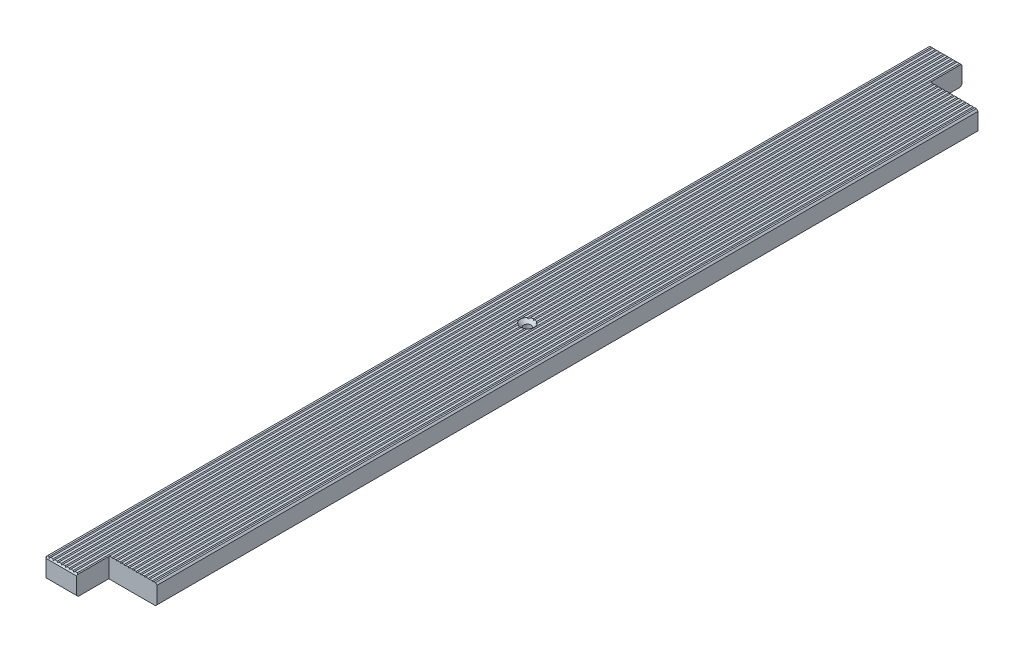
ISO-10303-21;
HEADER;
FILE_DESCRIPTION(('STEP AP214'),'2;1');
FILE_NAME('part.step','',(''),(''),'','','');
FILE_SCHEMA(('AUTOMOTIVE_DESIGN { 1 0 10303 214 1 1 1 1 }'));
ENDSEC;
DATA;
#1=APPLICATION_CONTEXT('core data for automotive mechanical design processes');
#2=APPLICATION_PROTOCOL_DEFINITION('international standard','automotive_design',2000,#1);
#3=PRODUCT_CONTEXT('',#1,'mechanical');
#4=PRODUCT('Part','Part','',(#3));
#5=PRODUCT_RELATED_PRODUCT_CATEGORY('part','',(#4));
#6=PRODUCT_DEFINITION_FORMATION('','',#4);
#7=PRODUCT_DEFINITION_CONTEXT('part definition',#1,'design');
#8=PRODUCT_DEFINITION('design','',#6,#7);
#9=PRODUCT_DEFINITION_SHAPE('','',#8);
#10=(LENGTH_UNIT() NAMED_UNIT(*) SI_UNIT(.MILLI.,.METRE.));
#11=(NAMED_UNIT(*) PLANE_ANGLE_UNIT() SI_UNIT($,.RADIAN.));
#12=(NAMED_UNIT(*) SI_UNIT($,.STERADIAN.) SOLID_ANGLE_UNIT());
#13=UNCERTAINTY_MEASURE_WITH_UNIT(LENGTH_MEASURE(1.E-05),#10,'distance_accuracy_value','');
#14=(GEOMETRIC_REPRESENTATION_CONTEXT(3) GLOBAL_UNCERTAINTY_ASSIGNED_CONTEXT((#13)) GLOBAL_UNIT_ASSIGNED_CONTEXT((#10,
#11,#12)) REPRESENTATION_CONTEXT('',''));
#15=CARTESIAN_POINT('',(0.,0.,0.));
#16=DIRECTION('',(0.,0.,1.));
#17=DIRECTION('',(1.,0.,0.));
#18=AXIS2_PLACEMENT_3D('',#15,#16,#17);
#19=CARTESIAN_POINT('',(50.,12.5,550.));
#20=DIRECTION('',(0.,-1.,0.));
#21=DIRECTION('',(1.,0.,0.));
#22=AXIS2_PLACEMENT_3D('',#19,#20,#21);
#23=PLANE('',#22);
#24=DIRECTION('',(0.,0.,1.));
#25=VECTOR('',#24,1.);
#26=CARTESIAN_POINT('',(-1.,12.5,-550.));
#27=LINE('',#26,#25);
#28=CARTESIAN_POINT('',(-1.00000000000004,12.5,-510.));
#29=VERTEX_POINT('',#28);
#30=CARTESIAN_POINT('',(-1.00000000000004,12.5,-8.59200209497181));
#31=VERTEX_POINT('',#30);
#32=EDGE_CURVE('E1005',#29,#31,#27,.T.);
#33=ORIENTED_EDGE('',*,*,#32,.F.);
#34=DIRECTION('',(1.,0.,0.));
#35=VECTOR('',#34,1.);
#36=CARTESIAN_POINT('',(50.,12.5,-510.));
#37=LINE('',#36,#35);
#38=CARTESIAN_POINT('',(-3.99999999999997,12.5,-510.));
#39=VERTEX_POINT('',#38);
#40=EDGE_CURVE('E560',#39,#29,#37,.T.);
#41=ORIENTED_EDGE('',*,*,#40,.F.);
#42=DIRECTION('',(0.,0.,1.));
#43=VECTOR('',#42,1.);
#44=CARTESIAN_POINT('',(-4.,12.5,-550.));
#45=LINE('',#44,#43);
#46=CARTESIAN_POINT('',(-3.99999999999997,12.5,-7.66958277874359));
#47=VERTEX_POINT('',#46);
#48=EDGE_CURVE('E1033',#39,#47,#45,.T.);
#49=ORIENTED_EDGE('',*,*,#48,.T.);
#50=CARTESIAN_POINT('',(0.,12.5,0.));
#51=DIRECTION('',(0.,1.,0.));
#52=DIRECTION('',(0.,0.,1.));
#53=AXIS2_PLACEMENT_3D('',#50,#51,#52);
#54=CIRCLE('',#53,8.65);
#55=EDGE_CURVE('E1008',#31,#47,#54,.T.);
#56=ORIENTED_EDGE('',*,*,#55,.F.);
#57=EDGE_LOOP('',(#33,#41,#49,#56));
#58=FACE_BOUND('',#57,.T.);
#59=ADVANCED_FACE('F30',(#58),#23,.F.);
#60=DIRECTION('',(0.,0.,1.));
#61=VECTOR('',#60,1.);
#62=CARTESIAN_POINT('',(4.,12.5,-550.));
#63=LINE('',#62,#61);
#64=CARTESIAN_POINT('',(3.99999999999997,12.5,-510.));
#65=VERTEX_POINT('',#64);
#66=CARTESIAN_POINT('',(3.99999999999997,12.5,-7.66958277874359));
#67=VERTEX_POINT('',#66);
#68=EDGE_CURVE('E1312',#65,#67,#63,.T.);
#69=ORIENTED_EDGE('',*,*,#68,.F.);
#70=CARTESIAN_POINT('',(1.00000000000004,12.5,-510.));
#71=VERTEX_POINT('',#70);
#72=EDGE_CURVE('E1542',#71,#65,#37,.T.);
#73=ORIENTED_EDGE('',*,*,#72,.F.);
#74=DIRECTION('',(0.,0.,1.));
#75=VECTOR('',#74,1.);
#76=CARTESIAN_POINT('',(1.,12.5,-550.));
#77=LINE('',#76,#75);
#78=CARTESIAN_POINT('',(1.00000000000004,12.5,-8.59200209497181));
#79=VERTEX_POINT('',#78);
#80=EDGE_CURVE('E1019',#71,#79,#77,.T.);
#81=ORIENTED_EDGE('',*,*,#80,.T.);
#82=EDGE_CURVE('E1353',#67,#79,#54,.T.);
#83=ORIENTED_EDGE('',*,*,#82,.F.);
#84=EDGE_LOOP('',(#69,#73,#81,#83));
#85=FACE_BOUND('',#84,.T.);
#86=ADVANCED_FACE('F996',(#85),#23,.F.);
#87=DIRECTION('',(0.,0.,1.));
#88=VECTOR('',#87,1.);
#89=CARTESIAN_POINT('',(-6.,12.5,-550.));
#90=LINE('',#89,#88);
#91=CARTESIAN_POINT('',(-6.00000000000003,12.5,-510.));
#92=VERTEX_POINT('',#91);
#93=CARTESIAN_POINT('',(-6.00000000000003,12.5,-6.23077041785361));
#94=VERTEX_POINT('',#93);
#95=EDGE_CURVE('E1029',#92,#94,#90,.T.);
#96=ORIENTED_EDGE('',*,*,#95,.F.);
#97=CARTESIAN_POINT('',(-8.99999999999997,12.5,-510.));
#98=VERTEX_POINT('',#97);
#99=EDGE_CURVE('E558',#98,#92,#37,.T.);
#100=ORIENTED_EDGE('',*,*,#99,.F.);
#101=DIRECTION('',(0.,0.,1.));
#102=VECTOR('',#101,1.);
#103=CARTESIAN_POINT('',(-8.99999999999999,12.5,-550.));
#104=LINE('',#103,#102);
#105=CARTESIAN_POINT('',(-8.99999999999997,12.5,510.));
#106=VERTEX_POINT('',#105);
#107=EDGE_CURVE('E1039',#98,#106,#104,.T.);
#108=ORIENTED_EDGE('',*,*,#107,.T.);
#109=DIRECTION('',(-1.,0.,0.));
#110=VECTOR('',#109,1.);
#111=CARTESIAN_POINT('',(50.,12.5,510.));
#112=LINE('',#111,#110);
#113=CARTESIAN_POINT('',(-6.00000000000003,12.5,510.));
#114=VERTEX_POINT('',#113);
#115=EDGE_CURVE('E638',#114,#106,#112,.T.);
#116=ORIENTED_EDGE('',*,*,#115,.F.);
#117=CARTESIAN_POINT('',(-6.00000000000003,12.5,6.23077041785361));
#118=VERTEX_POINT('',#117);
#119=EDGE_CURVE('E1032',#118,#114,#90,.T.);
#120=ORIENTED_EDGE('',*,*,#119,.F.);
#121=EDGE_CURVE('E1349',#94,#118,#54,.T.);
#122=ORIENTED_EDGE('',*,*,#121,.F.);
#123=EDGE_LOOP('',(#96,#100,#108,#116,#120,#122));
#124=FACE_BOUND('',#123,.T.);
#125=ADVANCED_FACE('F848',(#124),#23,.F.);
#126=CARTESIAN_POINT('',(-6.,12.5,-550.));
#127=DIRECTION('',(-0.707106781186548,-0.707106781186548,0.));
#128=DIRECTION('',(0.707106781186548,-0.707106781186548,0.));
#129=AXIS2_PLACEMENT_3D('',#126,#127,#128);
#130=PLANE('',#129);
#131=DIRECTION('',(0.,0.,1.));
#132=VECTOR('',#131,1.);
#133=CARTESIAN_POINT('',(-5.,11.5,-550.));
#134=LINE('',#133,#132);
#135=CARTESIAN_POINT('',(-5.,11.5,-510.));
#136=VERTEX_POINT('',#135);
#137=CARTESIAN_POINT('',(-5.,11.5,-5.78986182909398));
#138=VERTEX_POINT('',#137);
#139=EDGE_CURVE('E1016',#136,#138,#134,.T.);
#140=ORIENTED_EDGE('',*,*,#139,.F.);
#141=DIRECTION('',(-0.707106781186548,0.707106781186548,0.));
#142=VECTOR('',#141,1.);
#143=CARTESIAN_POINT('',(-6.,12.5,-510.));
#144=LINE('',#143,#142);
#145=EDGE_CURVE('E631',#136,#92,#144,.T.);
#146=ORIENTED_EDGE('',*,*,#145,.T.);
#147=ORIENTED_EDGE('',*,*,#95,.T.);
#148=CARTESIAN_POINT('',(-6.0002,12.5002,-6.23085547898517));
#149=CARTESIAN_POINT('',(-5.91657301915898,12.4165730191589,-6.19528829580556));
#150=CARTESIAN_POINT('',(-5.83300517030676,12.3330051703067,-6.15944252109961));
#151=CARTESIAN_POINT('',(-5.66599839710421,12.1659983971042,-6.08716671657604));
#152=CARTESIAN_POINT('',(-5.58255946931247,12.0825594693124,-6.0507367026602));
#153=CARTESIAN_POINT('',(-5.4158163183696,11.9158163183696,-5.97726327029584));
#154=CARTESIAN_POINT('',(-5.33251209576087,11.8325120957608,-5.94021984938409));
#155=CARTESIAN_POINT('',(-5.16604616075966,11.6660461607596,-5.86548714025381));
#156=CARTESIAN_POINT('',(-5.08288445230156,11.5828844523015,-5.82779783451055));
#157=CARTESIAN_POINT('',(-4.9998,11.4998,-5.78977028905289));
#158=B_SPLINE_CURVE_WITH_KNOTS('',3,(#148,#149,#150,#151,#152,#153,#154,#155,#156,#157),
.UNSPECIFIED.,.F.,.F.,(4,2,2,2,4),(0.,0.37049645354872,0.740982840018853,1.11147071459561,
1.48196865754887),.UNSPECIFIED.);
#159=EDGE_CURVE('E820',#94,#138,#158,.T.);
#160=ORIENTED_EDGE('',*,*,#159,.T.);
#161=EDGE_LOOP('',(#140,#146,#147,#160));
#162=FACE_BOUND('',#161,.T.);
#163=ADVANCED_FACE('F840',(#162),#130,.F.);
#164=CARTESIAN_POINT('',(-5.,11.5,-550.));
#165=DIRECTION('',(0.707106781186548,-0.707106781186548,0.));
#166=DIRECTION('',(0.707106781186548,0.707106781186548,0.));
#167=AXIS2_PLACEMENT_3D('',#164,#165,#166);
#168=PLANE('',#167);
#169=ORIENTED_EDGE('',*,*,#48,.F.);
#170=DIRECTION('',(-0.707106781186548,-0.707106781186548,0.));
#171=VECTOR('',#170,1.);
#172=CARTESIAN_POINT('',(-5.,11.5,-510.));
#173=LINE('',#172,#171);
#174=EDGE_CURVE('E628',#39,#136,#173,.T.);
#175=ORIENTED_EDGE('',*,*,#174,.T.);
#176=ORIENTED_EDGE('',*,*,#139,.T.);
#177=CARTESIAN_POINT('',(-5.0002,11.4998,-5.78942484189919));
#178=CARTESIAN_POINT('',(-4.92474055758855,11.5752594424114,-5.95429503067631));
#179=CARTESIAN_POINT('',(-4.84702409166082,11.6529759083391,-6.11707448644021));
#180=CARTESIAN_POINT('',(-4.68757250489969,11.8124274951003,-6.43837899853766));
#181=CARTESIAN_POINT('',(-4.60584199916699,11.894158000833,-6.59690863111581));
#182=CARTESIAN_POINT('',(-4.43870141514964,12.0612985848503,-6.90998232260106));
#183=CARTESIAN_POINT('',(-4.35329200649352,12.1467079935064,-7.06452709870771));
#184=CARTESIAN_POINT('',(-4.17902611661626,12.3209738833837,-7.36996987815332));
#185=CARTESIAN_POINT('',(-4.09016586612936,12.4098341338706,-7.52086358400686));
#186=CARTESIAN_POINT('',(-3.99979999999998,12.5002,-7.66991264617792));
#187=B_SPLINE_CURVE_WITH_KNOTS('',3,(#177,#178,#179,#180,#181,#182,#183,#184,#185,#186),
.UNSPECIFIED.,.F.,.F.,(4,2,2,2,4),(0.,0.589113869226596,1.17756558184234,1.76591063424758,
2.35491746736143),.UNSPECIFIED.);
#188=EDGE_CURVE('E814',#138,#47,#187,.T.);
#189=ORIENTED_EDGE('',*,*,#188,.T.);
#190=EDGE_LOOP('',(#169,#175,#176,#189));
#191=FACE_BOUND('',#190,.T.);
#192=ADVANCED_FACE('F836',(#191),#168,.F.);
#193=CARTESIAN_POINT('',(-1.,12.5,-550.));
#194=DIRECTION('',(-0.707106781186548,-0.707106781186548,0.));
#195=DIRECTION('',(0.707106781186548,-0.707106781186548,0.));
#196=AXIS2_PLACEMENT_3D('',#193,#194,#195);
#197=PLANE('',#196);
#198=DIRECTION('',(0.,0.,1.));
#199=VECTOR('',#198,1.);
#200=CARTESIAN_POINT('',(0.,11.5,-550.));
#201=LINE('',#200,#199);
#202=CARTESIAN_POINT('',(0.,11.4999999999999,-510.));
#203=VERTEX_POINT('',#202);
#204=CARTESIAN_POINT('',(0.,11.5,-7.64999999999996));
#205=VERTEX_POINT('',#204);
#206=EDGE_CURVE('E1026',#203,#205,#201,.T.);
#207=ORIENTED_EDGE('',*,*,#206,.F.);
#208=DIRECTION('',(-0.707106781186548,0.707106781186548,0.));
#209=VECTOR('',#208,1.);
#210=CARTESIAN_POINT('',(-1.,12.5,-510.));
#211=LINE('',#210,#209);
#212=EDGE_CURVE('E625',#203,#29,#211,.T.);
#213=ORIENTED_EDGE('',*,*,#212,.T.);
#214=ORIENTED_EDGE('',*,*,#32,.T.);
#215=CARTESIAN_POINT('',(-1.0002,12.5002,-8.59218016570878));
#216=CARTESIAN_POINT('',(-0.915416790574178,12.4154167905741,-8.51669218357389));
#217=CARTESIAN_POINT('',(-0.830948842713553,12.3309488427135,-8.4404935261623));
#218=CARTESIAN_POINT('',(-0.66271326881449,12.1627132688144,-8.28661204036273));
#219=CARTESIAN_POINT('',(-0.57894552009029,12.0789455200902,-8.20892948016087));
#220=CARTESIAN_POINT('',(-0.412147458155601,11.9121474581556,-8.0519882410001));
#221=CARTESIAN_POINT('',(-0.329117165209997,11.82911716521,-7.97272951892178));
#222=CARTESIAN_POINT('',(-0.163846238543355,11.6638462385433,-7.81253830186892));
#223=CARTESIAN_POINT('',(-0.0816057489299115,11.5816057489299,-7.73160550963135));
#224=CARTESIAN_POINT('',(0.000200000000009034,11.4997999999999,-7.64979999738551));
#225=B_SPLINE_CURVE_WITH_KNOTS('',3,(#215,#216,#217,#218,#219,#220,#221,#222,#223,#224),
.UNSPECIFIED.,.F.,.F.,(4,2,2,2,4),(0.,0.425056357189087,0.850036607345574,1.27502849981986,
1.70009651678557),.UNSPECIFIED.);
#226=EDGE_CURVE('E795',#31,#205,#225,.T.);
#227=ORIENTED_EDGE('',*,*,#226,.T.);
#228=EDGE_LOOP('',(#207,#213,#214,#227));
#229=FACE_BOUND('',#228,.T.);
#230=ADVANCED_FACE('F839',(#229),#197,.F.);
#231=CARTESIAN_POINT('',(0.,11.5,-550.));
#232=DIRECTION('',(0.707106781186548,-0.707106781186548,0.));
#233=DIRECTION('',(0.707106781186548,0.707106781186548,0.));
#234=AXIS2_PLACEMENT_3D('',#231,#232,#233);
#235=PLANE('',#234);
#236=ORIENTED_EDGE('',*,*,#80,.F.);
#237=DIRECTION('',(-0.707106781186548,-0.707106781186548,0.));
#238=VECTOR('',#237,1.);
#239=CARTESIAN_POINT('',(0.,11.5,-510.));
#240=LINE('',#239,#238);
#241=EDGE_CURVE('E622',#71,#203,#240,.T.);
#242=ORIENTED_EDGE('',*,*,#241,.T.);
#243=ORIENTED_EDGE('',*,*,#206,.T.);
#244=CARTESIAN_POINT('',(-0.000199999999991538,11.4998,-7.64979999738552));
#245=CARTESIAN_POINT('',(0.0816057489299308,11.5816057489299,-7.73160550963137));
#246=CARTESIAN_POINT('',(0.163846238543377,11.6638462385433,-7.81253830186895));
#247=CARTESIAN_POINT('',(0.329117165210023,11.82911716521,-7.9727295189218));
#248=CARTESIAN_POINT('',(0.412147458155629,11.9121474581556,-8.05198824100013));
#249=CARTESIAN_POINT('',(0.578945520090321,12.0789455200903,-8.2089294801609));
#250=CARTESIAN_POINT('',(0.662713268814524,12.1627132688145,-8.28661204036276));
#251=CARTESIAN_POINT('',(0.83094884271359,12.3309488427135,-8.44049352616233));
#252=CARTESIAN_POINT('',(0.915416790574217,12.4154167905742,-8.51669218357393));
#253=CARTESIAN_POINT('',(1.00020000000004,12.5002,-8.59218016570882));
#254=B_SPLINE_CURVE_WITH_KNOTS('',3,(#244,#245,#246,#247,#248,#249,#250,#251,#252,#253),
.UNSPECIFIED.,.F.,.F.,(4,2,2,2,4),(0.,0.425068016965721,0.850059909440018,1.27504015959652,
1.70009651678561),.UNSPECIFIED.);
#255=EDGE_CURVE('E789',#205,#79,#254,.T.);
#256=ORIENTED_EDGE('',*,*,#255,.T.);
#257=EDGE_LOOP('',(#236,#242,#243,#256));
#258=FACE_BOUND('',#257,.T.);
#259=ADVANCED_FACE('F1514',(#258),#235,.F.);
#260=CARTESIAN_POINT('',(4.,12.5,-550.));
#261=DIRECTION('',(-0.707106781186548,-0.707106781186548,0.));
#262=DIRECTION('',(0.707106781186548,-0.707106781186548,0.));
#263=AXIS2_PLACEMENT_3D('',#260,#261,#262);
#264=PLANE('',#263);
#265=DIRECTION('',(0.,0.,1.));
#266=VECTOR('',#265,1.);
#267=CARTESIAN_POINT('',(5.,11.5,-550.));
#268=LINE('',#267,#266);
#269=CARTESIAN_POINT('',(5.,11.5,-510.));
#270=VERTEX_POINT('',#269);
#271=CARTESIAN_POINT('',(5.,11.5,-5.78986182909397));
#272=VERTEX_POINT('',#271);
#273=EDGE_CURVE('E1022',#270,#272,#268,.T.);
#274=ORIENTED_EDGE('',*,*,#273,.F.);
#275=DIRECTION('',(-0.707106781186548,0.707106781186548,0.));
#276=VECTOR('',#275,1.);
#277=CARTESIAN_POINT('',(4.,12.5,-510.));
#278=LINE('',#277,#276);
#279=EDGE_CURVE('E619',#270,#65,#278,.T.);
#280=ORIENTED_EDGE('',*,*,#279,.T.);
#281=ORIENTED_EDGE('',*,*,#68,.T.);
#282=CARTESIAN_POINT('',(3.9998,12.5002,-7.66991264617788));
#283=CARTESIAN_POINT('',(4.09016586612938,12.4098341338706,-7.52086358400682));
#284=CARTESIAN_POINT('',(4.17902611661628,12.3209738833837,-7.36996987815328));
#285=CARTESIAN_POINT('',(4.35329200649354,12.1467079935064,-7.06452709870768));
#286=CARTESIAN_POINT('',(4.43870141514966,12.0612985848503,-6.90998232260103));
#287=CARTESIAN_POINT('',(4.605841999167,11.894158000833,-6.59690863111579));
#288=CARTESIAN_POINT('',(4.6875725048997,11.8124274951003,-6.43837899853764));
#289=CARTESIAN_POINT('',(4.84702409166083,11.6529759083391,-6.1170744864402));
#290=CARTESIAN_POINT('',(4.92474055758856,11.5752594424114,-5.9542950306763));
#291=CARTESIAN_POINT('',(5.0002,11.4998,-5.78942484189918));
#292=B_SPLINE_CURVE_WITH_KNOTS('',3,(#282,#283,#284,#285,#286,#287,#288,#289,#290,#291),
.UNSPECIFIED.,.F.,.F.,(4,2,2,2,4),(0.,0.589006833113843,1.17735188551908,1.7658035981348,
2.35491746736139),.UNSPECIFIED.);
#293=EDGE_CURVE('E742',#67,#272,#292,.T.);
#294=ORIENTED_EDGE('',*,*,#293,.T.);
#295=EDGE_LOOP('',(#274,#280,#281,#294));
#296=FACE_BOUND('',#295,.T.);
#297=ADVANCED_FACE('F755',(#296),#264,.F.);
#298=CARTESIAN_POINT('',(5.,11.5,-550.));
#299=DIRECTION('',(0.707106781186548,-0.707106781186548,0.));
#300=DIRECTION('',(0.707106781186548,0.707106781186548,0.));
#301=AXIS2_PLACEMENT_3D('',#298,#299,#300);
#302=PLANE('',#301);
#303=DIRECTION('',(0.,0.,1.));
#304=VECTOR('',#303,1.);
#305=CARTESIAN_POINT('',(6.00000000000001,12.5,-550.));
#306=LINE('',#305,#304);
#307=CARTESIAN_POINT('',(6.00000000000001,12.5,-510.));
#308=VERTEX_POINT('',#307);
#309=CARTESIAN_POINT('',(6.00000000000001,12.5,-6.23077041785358));
#310=VERTEX_POINT('',#309);
#311=EDGE_CURVE('E1314',#308,#310,#306,.T.);
#312=ORIENTED_EDGE('',*,*,#311,.F.);
#313=DIRECTION('',(-0.707106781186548,-0.707106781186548,0.));
#314=VECTOR('',#313,1.);
#315=CARTESIAN_POINT('',(5.,11.5,-510.));
#316=LINE('',#315,#314);
#317=EDGE_CURVE('E616',#308,#270,#316,.T.);
#318=ORIENTED_EDGE('',*,*,#317,.T.);
#319=ORIENTED_EDGE('',*,*,#273,.T.);
#320=CARTESIAN_POINT('',(4.9998,11.4997999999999,-5.78977028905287));
#321=CARTESIAN_POINT('',(5.08288445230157,11.5828844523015,-5.82779783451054));
#322=CARTESIAN_POINT('',(5.16604616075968,11.6660461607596,-5.8654871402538));
#323=CARTESIAN_POINT('',(5.3325120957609,11.8325120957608,-5.94021984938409));
#324=CARTESIAN_POINT('',(5.41581631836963,11.9158163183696,-5.97726327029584));
#325=CARTESIAN_POINT('',(5.58255946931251,12.0825594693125,-6.0507367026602));
#326=CARTESIAN_POINT('',(5.66599839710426,12.1659983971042,-6.08716671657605));
#327=CARTESIAN_POINT('',(5.83300517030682,12.3330051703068,-6.15944252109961));
#328=CARTESIAN_POINT('',(5.91657301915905,12.416573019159,-6.19528829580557));
#329=CARTESIAN_POINT('',(6.00020000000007,12.5002,-6.23085547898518));
#330=B_SPLINE_CURVE_WITH_KNOTS('',3,(#320,#321,#322,#323,#324,#325,#326,#327,#328,#329),
.UNSPECIFIED.,.F.,.F.,(4,2,2,2,4),(0.,0.370497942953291,0.740985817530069,1.11147220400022,
1.48196865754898),.UNSPECIFIED.);
#331=EDGE_CURVE('E773',#272,#310,#330,.T.);
#332=ORIENTED_EDGE('',*,*,#331,.T.);
#333=EDGE_LOOP('',(#312,#318,#319,#332));
#334=FACE_BOUND('',#333,.T.);
#335=ADVANCED_FACE('F1506',(#334),#302,.F.);
#336=CARTESIAN_POINT('',(1.00000000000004,12.5,8.59200209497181));
#337=VERTEX_POINT('',#336);
#338=CARTESIAN_POINT('',(1.00000000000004,12.5,510.));
#339=VERTEX_POINT('',#338);
#340=EDGE_CURVE('E1025',#337,#339,#77,.T.);
#341=ORIENTED_EDGE('',*,*,#340,.T.);
#342=CARTESIAN_POINT('',(3.99999999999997,12.5,510.));
#343=VERTEX_POINT('',#342);
#344=EDGE_CURVE('E1330',#343,#339,#112,.T.);
#345=ORIENTED_EDGE('',*,*,#344,.F.);
#346=CARTESIAN_POINT('',(3.99999999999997,12.5,7.66958277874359));
#347=VERTEX_POINT('',#346);
#348=EDGE_CURVE('E1313',#347,#343,#63,.T.);
#349=ORIENTED_EDGE('',*,*,#348,.F.);
#350=EDGE_CURVE('E733',#337,#347,#54,.T.);
#351=ORIENTED_EDGE('',*,*,#350,.F.);
#352=EDGE_LOOP('',(#341,#345,#349,#351));
#353=FACE_BOUND('',#352,.T.);
#354=ADVANCED_FACE('F1333',(#353),#23,.F.);
#355=CARTESIAN_POINT('',(-3.99999999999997,12.5,7.66958277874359));
#356=VERTEX_POINT('',#355);
#357=CARTESIAN_POINT('',(-3.99999999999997,12.5,510.));
#358=VERTEX_POINT('',#357);
#359=EDGE_CURVE('E1034',#356,#358,#45,.T.);
#360=ORIENTED_EDGE('',*,*,#359,.T.);
#361=CARTESIAN_POINT('',(-1.00000000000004,12.5,510.));
#362=VERTEX_POINT('',#361);
#363=EDGE_CURVE('E649',#362,#358,#112,.T.);
#364=ORIENTED_EDGE('',*,*,#363,.F.);
#365=CARTESIAN_POINT('',(-1.00000000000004,12.5,8.59200209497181));
#366=VERTEX_POINT('',#365);
#367=EDGE_CURVE('E1013',#366,#362,#27,.T.);
#368=ORIENTED_EDGE('',*,*,#367,.F.);
#369=EDGE_CURVE('E732',#356,#366,#54,.T.);
#370=ORIENTED_EDGE('',*,*,#369,.F.);
#371=EDGE_LOOP('',(#360,#364,#368,#370));
#372=FACE_BOUND('',#371,.T.);
#373=ADVANCED_FACE('F1346',(#372),#23,.F.);
#374=ORIENTED_EDGE('',*,*,#119,.T.);
#375=DIRECTION('',(0.707106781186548,-0.707106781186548,0.));
#376=VECTOR('',#375,1.);
#377=CARTESIAN_POINT('',(-6.,12.5,510.));
#378=LINE('',#377,#376);
#379=CARTESIAN_POINT('',(-5.,11.5,510.));
#380=VERTEX_POINT('',#379);
#381=EDGE_CURVE('E725',#114,#380,#378,.T.);
#382=ORIENTED_EDGE('',*,*,#381,.T.);
#383=CARTESIAN_POINT('',(-5.,11.5,5.78986182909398));
#384=VERTEX_POINT('',#383);
#385=EDGE_CURVE('E1012',#384,#380,#134,.T.);
#386=ORIENTED_EDGE('',*,*,#385,.F.);
#387=CARTESIAN_POINT('',(-4.99980000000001,11.4998,5.78977028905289));
#388=CARTESIAN_POINT('',(-5.08288445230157,11.5828844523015,5.82779783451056));
#389=CARTESIAN_POINT('',(-5.16604616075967,11.6660461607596,5.86548714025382));
#390=CARTESIAN_POINT('',(-5.33251209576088,11.8325120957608,5.9402198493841));
#391=CARTESIAN_POINT('',(-5.41581631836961,11.9158163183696,5.97726327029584));
#392=CARTESIAN_POINT('',(-5.58255946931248,12.0825594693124,6.0507367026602));
#393=CARTESIAN_POINT('',(-5.66599839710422,12.1659983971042,6.08716671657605));
#394=CARTESIAN_POINT('',(-5.83300517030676,12.3330051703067,6.15944252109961));
#395=CARTESIAN_POINT('',(-5.91657301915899,12.4165730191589,6.19528829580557));
#396=CARTESIAN_POINT('',(-6.0002,12.5002,6.23085547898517));
#397=B_SPLINE_CURVE_WITH_KNOTS('',3,(#387,#388,#389,#390,#391,#392,#393,#394,#395,#396),
.UNSPECIFIED.,.F.,.F.,(4,2,2,2,4),(0.,0.37049794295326,0.740985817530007,1.11147220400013,
1.48196865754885),.UNSPECIFIED.);
#398=EDGE_CURVE('E831',#384,#118,#397,.T.);
#399=ORIENTED_EDGE('',*,*,#398,.T.);
#400=EDGE_LOOP('',(#374,#382,#386,#399));
#401=FACE_BOUND('',#400,.T.);
#402=ADVANCED_FACE('F850',(#401),#130,.F.);
#403=ORIENTED_EDGE('',*,*,#385,.T.);
#404=DIRECTION('',(0.707106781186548,0.707106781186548,0.));
#405=VECTOR('',#404,1.);
#406=CARTESIAN_POINT('',(-5.,11.5,510.));
#407=LINE('',#406,#405);
#408=EDGE_CURVE('E722',#380,#358,#407,.T.);
#409=ORIENTED_EDGE('',*,*,#408,.T.);
#410=ORIENTED_EDGE('',*,*,#359,.F.);
#411=CARTESIAN_POINT('',(-3.99979999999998,12.5002,7.66991264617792));
#412=CARTESIAN_POINT('',(-4.09016586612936,12.4098341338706,7.52086358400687));
#413=CARTESIAN_POINT('',(-4.17902611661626,12.3209738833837,7.36996987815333));
#414=CARTESIAN_POINT('',(-4.35329200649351,12.1467079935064,7.06452709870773));
#415=CARTESIAN_POINT('',(-4.43870141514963,12.0612985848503,6.90998232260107));
#416=CARTESIAN_POINT('',(-4.60584199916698,11.894158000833,6.59690863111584));
#417=CARTESIAN_POINT('',(-4.68757250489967,11.8124274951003,6.43837899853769));
#418=CARTESIAN_POINT('',(-4.8470240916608,11.6529759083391,6.11707448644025));
#419=CARTESIAN_POINT('',(-4.92474055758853,11.5752594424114,5.95429503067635));
#420=CARTESIAN_POINT('',(-5.00019999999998,11.4998,5.78942484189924));
#421=B_SPLINE_CURVE_WITH_KNOTS('',3,(#411,#412,#413,#414,#415,#416,#417,#418,#419,#420),
.UNSPECIFIED.,.F.,.F.,(4,2,2,2,4),(0.,0.589006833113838,1.17735188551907,1.76580359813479,
2.35491746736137),.UNSPECIFIED.);
#422=EDGE_CURVE('E826',#356,#384,#421,.T.);
#423=ORIENTED_EDGE('',*,*,#422,.T.);
#424=EDGE_LOOP('',(#403,#409,#410,#423));
#425=FACE_BOUND('',#424,.T.);
#426=ADVANCED_FACE('F842',(#425),#168,.F.);
#427=ORIENTED_EDGE('',*,*,#367,.T.);
#428=DIRECTION('',(0.707106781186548,-0.707106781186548,0.));
#429=VECTOR('',#428,1.);
#430=CARTESIAN_POINT('',(-1.,12.5,510.));
#431=LINE('',#430,#429);
#432=CARTESIAN_POINT('',(0.,11.5,510.));
#433=VERTEX_POINT('',#432);
#434=EDGE_CURVE('E719',#362,#433,#431,.T.);
#435=ORIENTED_EDGE('',*,*,#434,.T.);
#436=CARTESIAN_POINT('',(0.,11.5,7.64999999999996));
#437=VERTEX_POINT('',#436);
#438=EDGE_CURVE('E1028',#437,#433,#201,.T.);
#439=ORIENTED_EDGE('',*,*,#438,.F.);
#440=CARTESIAN_POINT('',(0.000200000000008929,11.4997999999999,7.64979999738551));
#441=CARTESIAN_POINT('',(-0.0816057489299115,11.5816057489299,7.73160550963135));
#442=CARTESIAN_POINT('',(-0.163846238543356,11.6638462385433,7.81253830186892));
#443=CARTESIAN_POINT('',(-0.329117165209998,11.82911716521,7.97272951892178));
#444=CARTESIAN_POINT('',(-0.412147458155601,11.9121474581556,8.0519882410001));
#445=CARTESIAN_POINT('',(-0.578945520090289,12.0789455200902,8.20892948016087));
#446=CARTESIAN_POINT('',(-0.662713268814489,12.1627132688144,8.28661204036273));
#447=CARTESIAN_POINT('',(-0.830948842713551,12.3309488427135,8.4404935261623));
#448=CARTESIAN_POINT('',(-0.915416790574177,12.4154167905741,8.51669218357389));
#449=CARTESIAN_POINT('',(-1.0002,12.5002,8.59218016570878));
#450=B_SPLINE_CURVE_WITH_KNOTS('',3,(#440,#441,#442,#443,#444,#445,#446,#447,#448,#449),
.UNSPECIFIED.,.F.,.F.,(4,2,2,2,4),(0.,0.425068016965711,0.850059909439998,1.27504015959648,
1.70009651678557),.UNSPECIFIED.);
#451=EDGE_CURVE('E808',#437,#366,#450,.T.);
#452=ORIENTED_EDGE('',*,*,#451,.T.);
#453=EDGE_LOOP('',(#427,#435,#439,#452));
#454=FACE_BOUND('',#453,.T.);
#455=ADVANCED_FACE('F1525',(#454),#197,.F.);
#456=ORIENTED_EDGE('',*,*,#438,.T.);
#457=DIRECTION('',(0.707106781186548,0.707106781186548,0.));
#458=VECTOR('',#457,1.);
#459=CARTESIAN_POINT('',(0.,11.5,510.));
#460=LINE('',#459,#458);
#461=EDGE_CURVE('E716',#433,#339,#460,.T.);
#462=ORIENTED_EDGE('',*,*,#461,.T.);
#463=ORIENTED_EDGE('',*,*,#340,.F.);
#464=CARTESIAN_POINT('',(1.00020000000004,12.5002,8.59218016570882));
#465=CARTESIAN_POINT('',(0.915416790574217,12.4154167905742,8.51669218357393));
#466=CARTESIAN_POINT('',(0.830948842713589,12.3309488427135,8.44049352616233));
#467=CARTESIAN_POINT('',(0.662713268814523,12.1627132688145,8.28661204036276));
#468=CARTESIAN_POINT('',(0.57894552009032,12.0789455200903,8.2089294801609));
#469=CARTESIAN_POINT('',(0.412147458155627,11.9121474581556,8.05198824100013));
#470=CARTESIAN_POINT('',(0.329117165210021,11.82911716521,7.9727295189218));
#471=CARTESIAN_POINT('',(0.163846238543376,11.6638462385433,7.81253830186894));
#472=CARTESIAN_POINT('',(0.0816057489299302,11.5816057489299,7.73160550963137));
#473=CARTESIAN_POINT('',(-0.000199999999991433,11.4998,7.64979999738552));
#474=B_SPLINE_CURVE_WITH_KNOTS('',3,(#464,#465,#466,#467,#468,#469,#470,#471,#472,#473),
.UNSPECIFIED.,.F.,.F.,(4,2,2,2,4),(0.,0.425056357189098,0.850036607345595,1.2750284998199,
1.70009651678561),.UNSPECIFIED.);
#475=EDGE_CURVE('E802',#337,#437,#474,.T.);
#476=ORIENTED_EDGE('',*,*,#475,.T.);
#477=EDGE_LOOP('',(#456,#462,#463,#476));
#478=FACE_BOUND('',#477,.T.);
#479=ADVANCED_FACE('F1521',(#478),#235,.F.);
#480=ORIENTED_EDGE('',*,*,#348,.T.);
#481=DIRECTION('',(0.707106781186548,-0.707106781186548,0.));
#482=VECTOR('',#481,1.);
#483=CARTESIAN_POINT('',(4.,12.5,510.));
#484=LINE('',#483,#482);
#485=CARTESIAN_POINT('',(5.,11.5,510.));
#486=VERTEX_POINT('',#485);
#487=EDGE_CURVE('E713',#343,#486,#484,.T.);
#488=ORIENTED_EDGE('',*,*,#487,.T.);
#489=CARTESIAN_POINT('',(5.,11.5,5.78986182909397));
#490=VERTEX_POINT('',#489);
#491=EDGE_CURVE('E1308',#490,#486,#268,.T.);
#492=ORIENTED_EDGE('',*,*,#491,.F.);
#493=CARTESIAN_POINT('',(5.00019999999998,11.4998,5.78942484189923));
#494=CARTESIAN_POINT('',(4.92474055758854,11.5752594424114,5.95429503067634));
#495=CARTESIAN_POINT('',(4.84702409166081,11.6529759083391,6.11707448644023));
#496=CARTESIAN_POINT('',(4.68757250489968,11.8124274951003,6.43837899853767));
#497=CARTESIAN_POINT('',(4.60584199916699,11.894158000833,6.59690863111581));
#498=CARTESIAN_POINT('',(4.43870141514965,12.0612985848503,6.90998232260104));
#499=CARTESIAN_POINT('',(4.35329200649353,12.1467079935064,7.0645270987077));
#500=CARTESIAN_POINT('',(4.17902611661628,12.3209738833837,7.36996987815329));
#501=CARTESIAN_POINT('',(4.09016586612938,12.4098341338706,7.52086358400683));
#502=CARTESIAN_POINT('',(3.9998,12.5002,7.66991264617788));
#503=B_SPLINE_CURVE_WITH_KNOTS('',3,(#493,#494,#495,#496,#497,#498,#499,#500,#501,#502),
.UNSPECIFIED.,.F.,.F.,(4,2,2,2,4),(0.,0.589113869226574,1.17756558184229,1.76591063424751,
2.35491746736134),.UNSPECIFIED.);
#504=EDGE_CURVE('E750',#490,#347,#503,.T.);
#505=ORIENTED_EDGE('',*,*,#504,.T.);
#506=EDGE_LOOP('',(#480,#488,#492,#505));
#507=FACE_BOUND('',#506,.T.);
#508=ADVANCED_FACE('F1327',(#507),#264,.F.);
#509=ORIENTED_EDGE('',*,*,#491,.T.);
#510=DIRECTION('',(0.707106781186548,0.707106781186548,0.));
#511=VECTOR('',#510,1.);
#512=CARTESIAN_POINT('',(5.,11.5,510.));
#513=LINE('',#512,#511);
#514=CARTESIAN_POINT('',(6.00000000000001,12.5,510.));
#515=VERTEX_POINT('',#514);
#516=EDGE_CURVE('E710',#486,#515,#513,.T.);
#517=ORIENTED_EDGE('',*,*,#516,.T.);
#518=CARTESIAN_POINT('',(6.00000000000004,12.5,6.2307704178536));
#519=VERTEX_POINT('',#518);
#520=EDGE_CURVE('E1315',#519,#515,#306,.T.);
#521=ORIENTED_EDGE('',*,*,#520,.F.);
#522=CARTESIAN_POINT('',(6.00020000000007,12.5002,6.23085547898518));
#523=CARTESIAN_POINT('',(5.91657301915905,12.416573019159,6.19528829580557));
#524=CARTESIAN_POINT('',(5.83300517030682,12.3330051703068,6.15944252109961));
#525=CARTESIAN_POINT('',(5.66599839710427,12.1659983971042,6.08716671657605));
#526=CARTESIAN_POINT('',(5.58255946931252,12.0825594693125,6.0507367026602));
#527=CARTESIAN_POINT('',(5.41581631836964,11.9158163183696,5.97726327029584));
#528=CARTESIAN_POINT('',(5.33251209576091,11.8325120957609,5.94021984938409));
#529=CARTESIAN_POINT('',(5.16604616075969,11.6660461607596,5.8654871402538));
#530=CARTESIAN_POINT('',(5.08288445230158,11.5828844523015,5.82779783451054));
#531=CARTESIAN_POINT('',(4.99980000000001,11.4998,5.78977028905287));
#532=B_SPLINE_CURVE_WITH_KNOTS('',3,(#522,#523,#524,#525,#526,#527,#528,#529,#530,#531),
.UNSPECIFIED.,.F.,.F.,(4,2,2,2,4),(0.,0.370496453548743,0.740982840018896,1.11147071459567,
1.48196865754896),.UNSPECIFIED.);
#533=EDGE_CURVE('E782',#519,#490,#532,.T.);
#534=ORIENTED_EDGE('',*,*,#533,.T.);
#535=EDGE_LOOP('',(#509,#517,#521,#534));
#536=FACE_BOUND('',#535,.T.);
#537=ADVANCED_FACE('F1324',(#536),#302,.F.);
#538=DIRECTION('',(0.,0.,1.));
#539=VECTOR('',#538,1.);
#540=CARTESIAN_POINT('',(44.,12.4999999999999,-550.));
#541=LINE('',#540,#539);
#542=CARTESIAN_POINT('',(43.9999999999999,12.5,-510.));
#543=VERTEX_POINT('',#542);
#544=CARTESIAN_POINT('',(43.9999999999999,12.5,510.));
#545=VERTEX_POINT('',#544);
#546=EDGE_CURVE('E1263',#543,#545,#541,.T.);
#547=ORIENTED_EDGE('',*,*,#546,.F.);
#548=CARTESIAN_POINT('',(41.0000000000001,12.5,-510.));
#549=VERTEX_POINT('',#548);
#550=EDGE_CURVE('E564',#549,#543,#37,.T.);
#551=ORIENTED_EDGE('',*,*,#550,.F.);
#552=DIRECTION('',(0.,0.,1.));
#553=VECTOR('',#552,1.);
#554=CARTESIAN_POINT('',(41.,12.4999999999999,-550.));
#555=LINE('',#554,#553);
#556=CARTESIAN_POINT('',(41.0000000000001,12.5,510.));
#557=VERTEX_POINT('',#556);
#558=EDGE_CURVE('E1267',#549,#557,#555,.T.);
#559=ORIENTED_EDGE('',*,*,#558,.T.);
#560=EDGE_CURVE('E1419',#545,#557,#112,.T.);
#561=ORIENTED_EDGE('',*,*,#560,.F.);
#562=EDGE_LOOP('',(#547,#551,#559,#561));
#563=FACE_BOUND('',#562,.T.);
#564=ADVANCED_FACE('F1411',(#563),#23,.F.);
#565=DIRECTION('',(0.,0.,1.));
#566=VECTOR('',#565,1.);
#567=CARTESIAN_POINT('',(39.,12.4999999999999,-550.));
#568=LINE('',#567,#566);
#569=CARTESIAN_POINT('',(38.9999999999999,12.5,-510.));
#570=VERTEX_POINT('',#569);
#571=CARTESIAN_POINT('',(38.9999999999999,12.5,510.));
#572=VERTEX_POINT('',#571);
#573=EDGE_CURVE('E1272',#570,#572,#568,.T.);
#574=ORIENTED_EDGE('',*,*,#573,.F.);
#575=CARTESIAN_POINT('',(36.0000000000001,12.5,-510.));
#576=VERTEX_POINT('',#575);
#577=EDGE_CURVE('E1407',#576,#570,#37,.T.);
#578=ORIENTED_EDGE('',*,*,#577,.F.);
#579=DIRECTION('',(0.,0.,1.));
#580=VECTOR('',#579,1.);
#581=CARTESIAN_POINT('',(36.,12.4999999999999,-550.));
#582=LINE('',#581,#580);
#583=CARTESIAN_POINT('',(36.0000000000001,12.5,510.));
#584=VERTEX_POINT('',#583);
#585=EDGE_CURVE('E1279',#576,#584,#582,.T.);
#586=ORIENTED_EDGE('',*,*,#585,.T.);
#587=EDGE_CURVE('E1426',#572,#584,#112,.T.);
#588=ORIENTED_EDGE('',*,*,#587,.F.);
#589=EDGE_LOOP('',(#574,#578,#586,#588));
#590=FACE_BOUND('',#589,.T.);
#591=ADVANCED_FACE('F1424',(#590),#23,.F.);
#592=DIRECTION('',(0.,0.,1.));
#593=VECTOR('',#592,1.);
#594=CARTESIAN_POINT('',(34.,12.4999999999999,-550.));
#595=LINE('',#594,#593);
#596=CARTESIAN_POINT('',(33.9999999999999,12.5,-510.));
#597=VERTEX_POINT('',#596);
#598=CARTESIAN_POINT('',(33.9999999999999,12.5,510.));
#599=VERTEX_POINT('',#598);
#600=EDGE_CURVE('E1276',#597,#599,#595,.T.);
#601=ORIENTED_EDGE('',*,*,#600,.F.);
#602=CARTESIAN_POINT('',(31.0000000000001,12.5,-510.));
#603=VERTEX_POINT('',#602);
#604=EDGE_CURVE('E1405',#603,#597,#37,.T.);
#605=ORIENTED_EDGE('',*,*,#604,.F.);
#606=DIRECTION('',(0.,0.,1.));
#607=VECTOR('',#606,1.);
#608=CARTESIAN_POINT('',(31.,12.4999999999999,-550.));
#609=LINE('',#608,#607);
#610=CARTESIAN_POINT('',(31.0000000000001,12.5,510.));
#611=VERTEX_POINT('',#610);
#612=EDGE_CURVE('E1285',#603,#611,#609,.T.);
#613=ORIENTED_EDGE('',*,*,#612,.T.);
#614=EDGE_CURVE('E1428',#599,#611,#112,.T.);
#615=ORIENTED_EDGE('',*,*,#614,.F.);
#616=EDGE_LOOP('',(#601,#605,#613,#615));
#617=FACE_BOUND('',#616,.T.);
#618=ADVANCED_FACE('F1468',(#617),#23,.F.);
#619=DIRECTION('',(0.,0.,1.));
#620=VECTOR('',#619,1.);
#621=CARTESIAN_POINT('',(29.,12.4999999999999,-550.));
#622=LINE('',#621,#620);
#623=CARTESIAN_POINT('',(28.9999999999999,12.5,-510.));
#624=VERTEX_POINT('',#623);
#625=CARTESIAN_POINT('',(28.9999999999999,12.5,510.));
#626=VERTEX_POINT('',#625);
#627=EDGE_CURVE('E1282',#624,#626,#622,.T.);
#628=ORIENTED_EDGE('',*,*,#627,.F.);
#629=CARTESIAN_POINT('',(26.0000000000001,12.5,-510.));
#630=VERTEX_POINT('',#629);
#631=EDGE_CURVE('E1403',#630,#624,#37,.T.);
#632=ORIENTED_EDGE('',*,*,#631,.F.);
#633=DIRECTION('',(0.,0.,1.));
#634=VECTOR('',#633,1.);
#635=CARTESIAN_POINT('',(26.,12.4999999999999,-550.));
#636=LINE('',#635,#634);
#637=CARTESIAN_POINT('',(26.0000000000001,12.5,510.));
#638=VERTEX_POINT('',#637);
#639=EDGE_CURVE('E1291',#630,#638,#636,.T.);
#640=ORIENTED_EDGE('',*,*,#639,.T.);
#641=EDGE_CURVE('E1430',#626,#638,#112,.T.);
#642=ORIENTED_EDGE('',*,*,#641,.F.);
#643=EDGE_LOOP('',(#628,#632,#640,#642));
#644=FACE_BOUND('',#643,.T.);
#645=ADVANCED_FACE('F1459',(#644),#23,.F.);
#646=DIRECTION('',(0.,0.,1.));
#647=VECTOR('',#646,1.);
#648=CARTESIAN_POINT('',(24.,12.4999999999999,-550.));
#649=LINE('',#648,#647);
#650=CARTESIAN_POINT('',(24.,12.5,-510.));
#651=VERTEX_POINT('',#650);
#652=CARTESIAN_POINT('',(24.,12.5,510.));
#653=VERTEX_POINT('',#652);
#654=EDGE_CURVE('E1288',#651,#653,#649,.T.);
#655=ORIENTED_EDGE('',*,*,#654,.F.);
#656=CARTESIAN_POINT('',(21.0000000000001,12.5,-510.));
#657=VERTEX_POINT('',#656);
#658=EDGE_CURVE('E1401',#657,#651,#37,.T.);
#659=ORIENTED_EDGE('',*,*,#658,.F.);
#660=DIRECTION('',(0.,0.,1.));
#661=VECTOR('',#660,1.);
#662=CARTESIAN_POINT('',(21.,12.4999999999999,-550.));
#663=LINE('',#662,#661);
#664=CARTESIAN_POINT('',(21.0000000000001,12.5,510.));
#665=VERTEX_POINT('',#664);
#666=EDGE_CURVE('E1297',#657,#665,#663,.T.);
#667=ORIENTED_EDGE('',*,*,#666,.T.);
#668=EDGE_CURVE('E1435',#653,#665,#112,.T.);
#669=ORIENTED_EDGE('',*,*,#668,.F.);
#670=EDGE_LOOP('',(#655,#659,#667,#669));
#671=FACE_BOUND('',#670,.T.);
#672=ADVANCED_FACE('F1377',(#671),#23,.F.);
#673=DIRECTION('',(0.,0.,1.));
#674=VECTOR('',#673,1.);
#675=CARTESIAN_POINT('',(19.,12.4999999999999,-550.));
#676=LINE('',#675,#674);
#677=CARTESIAN_POINT('',(19.,12.5,-510.));
#678=VERTEX_POINT('',#677);
#679=CARTESIAN_POINT('',(19.,12.5,510.));
#680=VERTEX_POINT('',#679);
#681=EDGE_CURVE('E1294',#678,#680,#676,.T.);
#682=ORIENTED_EDGE('',*,*,#681,.F.);
#683=CARTESIAN_POINT('',(16.,12.5,-510.));
#684=VERTEX_POINT('',#683);
#685=EDGE_CURVE('E1399',#684,#678,#37,.T.);
#686=ORIENTED_EDGE('',*,*,#685,.F.);
#687=DIRECTION('',(0.,0.,1.));
#688=VECTOR('',#687,1.);
#689=CARTESIAN_POINT('',(16.,12.4999999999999,-550.));
#690=LINE('',#689,#688);
#691=CARTESIAN_POINT('',(16.,12.5,510.));
#692=VERTEX_POINT('',#691);
#693=EDGE_CURVE('E1303',#684,#692,#690,.T.);
#694=ORIENTED_EDGE('',*,*,#693,.T.);
#695=EDGE_CURVE('E1394',#680,#692,#112,.T.);
#696=ORIENTED_EDGE('',*,*,#695,.F.);
#697=EDGE_LOOP('',(#682,#686,#694,#696));
#698=FACE_BOUND('',#697,.T.);
#699=ADVANCED_FACE('F1372',(#698),#23,.F.);
#700=DIRECTION('',(0.,0.,1.));
#701=VECTOR('',#700,1.);
#702=CARTESIAN_POINT('',(14.,12.4999999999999,-550.));
#703=LINE('',#702,#701);
#704=CARTESIAN_POINT('',(14.,12.5,-510.));
#705=VERTEX_POINT('',#704);
#706=CARTESIAN_POINT('',(14.,12.5,510.));
#707=VERTEX_POINT('',#706);
#708=EDGE_CURVE('E1300',#705,#707,#703,.T.);
#709=ORIENTED_EDGE('',*,*,#708,.F.);
#710=CARTESIAN_POINT('',(11.,12.5,-510.));
#711=VERTEX_POINT('',#710);
#712=EDGE_CURVE('E1382',#711,#705,#37,.T.);
#713=ORIENTED_EDGE('',*,*,#712,.F.);
#714=DIRECTION('',(0.,0.,1.));
#715=VECTOR('',#714,1.);
#716=CARTESIAN_POINT('',(11.,12.5,-550.));
#717=LINE('',#716,#715);
#718=CARTESIAN_POINT('',(11.,12.5,510.));
#719=VERTEX_POINT('',#718);
#720=EDGE_CURVE('E1309',#711,#719,#717,.T.);
#721=ORIENTED_EDGE('',*,*,#720,.T.);
#722=EDGE_CURVE('E1337',#707,#719,#112,.T.);
#723=ORIENTED_EDGE('',*,*,#722,.F.);
#724=EDGE_LOOP('',(#709,#713,#721,#723));
#725=FACE_BOUND('',#724,.T.);
#726=ADVANCED_FACE('F1365',(#725),#23,.F.);
#727=DIRECTION('',(0.,0.,1.));
#728=VECTOR('',#727,1.);
#729=CARTESIAN_POINT('',(9.,12.5,-550.));
#730=LINE('',#729,#728);
#731=CARTESIAN_POINT('',(8.99999999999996,12.5,-510.));
#732=VERTEX_POINT('',#731);
#733=CARTESIAN_POINT('',(8.99999999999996,12.5,510.));
#734=VERTEX_POINT('',#733);
#735=EDGE_CURVE('E1306',#732,#734,#730,.T.);
#736=ORIENTED_EDGE('',*,*,#735,.F.);
#737=EDGE_CURVE('E1402',#308,#732,#37,.T.);
#738=ORIENTED_EDGE('',*,*,#737,.F.);
#739=ORIENTED_EDGE('',*,*,#311,.T.);
#740=EDGE_CURVE('E736',#519,#310,#54,.T.);
#741=ORIENTED_EDGE('',*,*,#740,.F.);
#742=ORIENTED_EDGE('',*,*,#520,.T.);
#743=EDGE_CURVE('E1336',#734,#515,#112,.T.);
#744=ORIENTED_EDGE('',*,*,#743,.F.);
#745=EDGE_LOOP('',(#736,#738,#739,#741,#742,#744));
#746=FACE_BOUND('',#745,.T.);
#747=ADVANCED_FACE('F1362',(#746),#23,.F.);
#748=DIRECTION('',(1.,0.,0.));
#749=VECTOR('',#748,1.);
#750=CARTESIAN_POINT('',(50.,12.5,548.));
#751=LINE('',#750,#749);
#752=CARTESIAN_POINT('',(-13.9999999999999,12.5,548.));
#753=VERTEX_POINT('',#752);
#754=CARTESIAN_POINT('',(-11.,12.5,548.));
#755=VERTEX_POINT('',#754);
#756=EDGE_CURVE('E1173',#753,#755,#751,.T.);
#757=ORIENTED_EDGE('',*,*,#756,.T.);
#758=DIRECTION('',(0.,0.,1.));
#759=VECTOR('',#758,1.);
#760=CARTESIAN_POINT('',(-11.,12.5,-550.));
#761=LINE('',#760,#759);
#762=CARTESIAN_POINT('',(-11.,12.5,-548.));
#763=VERTEX_POINT('',#762);
#764=EDGE_CURVE('E1036',#763,#755,#761,.T.);
#765=ORIENTED_EDGE('',*,*,#764,.F.);
#766=DIRECTION('',(-1.,0.,0.));
#767=VECTOR('',#766,1.);
#768=CARTESIAN_POINT('',(50.,12.5,-548.));
#769=LINE('',#768,#767);
#770=CARTESIAN_POINT('',(-14.,12.5,-548.));
#771=VERTEX_POINT('',#770);
#772=EDGE_CURVE('E1168',#763,#771,#769,.T.);
#773=ORIENTED_EDGE('',*,*,#772,.T.);
#774=DIRECTION('',(0.,0.,1.));
#775=VECTOR('',#774,1.);
#776=CARTESIAN_POINT('',(-14.,12.5,-550.));
#777=LINE('',#776,#775);
#778=EDGE_CURVE('E1049',#771,#753,#777,.T.);
#779=ORIENTED_EDGE('',*,*,#778,.T.);
#780=EDGE_LOOP('',(#757,#765,#773,#779));
#781=FACE_BOUND('',#780,.T.);
#782=ADVANCED_FACE('F1364',(#781),#23,.F.);
#783=CARTESIAN_POINT('',(-19.,12.5,548.));
#784=VERTEX_POINT('',#783);
#785=CARTESIAN_POINT('',(-16.,12.5,548.));
#786=VERTEX_POINT('',#785);
#787=EDGE_CURVE('E1581',#784,#786,#751,.T.);
#788=ORIENTED_EDGE('',*,*,#787,.T.);
#789=DIRECTION('',(0.,0.,1.));
#790=VECTOR('',#789,1.);
#791=CARTESIAN_POINT('',(-16.,12.5,-550.));
#792=LINE('',#791,#790);
#793=CARTESIAN_POINT('',(-16.,12.5,-548.));
#794=VERTEX_POINT('',#793);
#795=EDGE_CURVE('E1046',#794,#786,#792,.T.);
#796=ORIENTED_EDGE('',*,*,#795,.F.);
#797=CARTESIAN_POINT('',(-19.,12.5,-548.));
#798=VERTEX_POINT('',#797);
#799=EDGE_CURVE('E1171',#794,#798,#769,.T.);
#800=ORIENTED_EDGE('',*,*,#799,.T.);
#801=DIRECTION('',(0.,0.,1.));
#802=VECTOR('',#801,1.);
#803=CARTESIAN_POINT('',(-19.,12.5,-550.));
#804=LINE('',#803,#802);
#805=EDGE_CURVE('E1061',#798,#784,#804,.T.);
#806=ORIENTED_EDGE('',*,*,#805,.T.);
#807=EDGE_LOOP('',(#788,#796,#800,#806));
#808=FACE_BOUND('',#807,.T.);
#809=ADVANCED_FACE('F1370',(#808),#23,.F.);
#810=CARTESIAN_POINT('',(-24.,12.5,548.));
#811=VERTEX_POINT('',#810);
#812=CARTESIAN_POINT('',(-21.,12.5,548.));
#813=VERTEX_POINT('',#812);
#814=EDGE_CURVE('E1584',#811,#813,#751,.T.);
#815=ORIENTED_EDGE('',*,*,#814,.T.);
#816=DIRECTION('',(0.,0.,1.));
#817=VECTOR('',#816,1.);
#818=CARTESIAN_POINT('',(-21.,12.5,-550.));
#819=LINE('',#818,#817);
#820=CARTESIAN_POINT('',(-21.,12.5,-548.));
#821=VERTEX_POINT('',#820);
#822=EDGE_CURVE('E1058',#821,#813,#819,.T.);
#823=ORIENTED_EDGE('',*,*,#822,.F.);
#824=CARTESIAN_POINT('',(-23.9999999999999,12.5,-548.));
#825=VERTEX_POINT('',#824);
#826=EDGE_CURVE('E2227',#821,#825,#769,.T.);
#827=ORIENTED_EDGE('',*,*,#826,.T.);
#828=DIRECTION('',(0.,0.,1.));
#829=VECTOR('',#828,1.);
#830=CARTESIAN_POINT('',(-24.,12.5,-550.));
#831=LINE('',#830,#829);
#832=EDGE_CURVE('E1073',#825,#811,#831,.T.);
#833=ORIENTED_EDGE('',*,*,#832,.T.);
#834=EDGE_LOOP('',(#815,#823,#827,#833));
#835=FACE_BOUND('',#834,.T.);
#836=ADVANCED_FACE('F1680',(#835),#23,.F.);
#837=CARTESIAN_POINT('',(-28.9999999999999,12.5,548.));
#838=VERTEX_POINT('',#837);
#839=CARTESIAN_POINT('',(-26.,12.5,548.));
#840=VERTEX_POINT('',#839);
#841=EDGE_CURVE('E1586',#838,#840,#751,.T.);
#842=ORIENTED_EDGE('',*,*,#841,.T.);
#843=DIRECTION('',(0.,0.,1.));
#844=VECTOR('',#843,1.);
#845=CARTESIAN_POINT('',(-26.,12.5,-550.));
#846=LINE('',#845,#844);
#847=CARTESIAN_POINT('',(-26.,12.5,-548.));
#848=VERTEX_POINT('',#847);
#849=EDGE_CURVE('E1070',#848,#840,#846,.T.);
#850=ORIENTED_EDGE('',*,*,#849,.F.);
#851=CARTESIAN_POINT('',(-29.,12.5,-548.));
#852=VERTEX_POINT('',#851);
#853=EDGE_CURVE('E2224',#848,#852,#769,.T.);
#854=ORIENTED_EDGE('',*,*,#853,.T.);
#855=DIRECTION('',(0.,0.,1.));
#856=VECTOR('',#855,1.);
#857=CARTESIAN_POINT('',(-29.,12.5,-550.));
#858=LINE('',#857,#856);
#859=EDGE_CURVE('E1085',#852,#838,#858,.T.);
#860=ORIENTED_EDGE('',*,*,#859,.T.);
#861=EDGE_LOOP('',(#842,#850,#854,#860));
#862=FACE_BOUND('',#861,.T.);
#863=ADVANCED_FACE('F1676',(#862),#23,.F.);
#864=CARTESIAN_POINT('',(-34.,12.5,548.));
#865=VERTEX_POINT('',#864);
#866=CARTESIAN_POINT('',(-31.,12.5,548.));
#867=VERTEX_POINT('',#866);
#868=EDGE_CURVE('E1591',#865,#867,#751,.T.);
#869=ORIENTED_EDGE('',*,*,#868,.T.);
#870=DIRECTION('',(0.,0.,1.));
#871=VECTOR('',#870,1.);
#872=CARTESIAN_POINT('',(-31.,12.5,-550.));
#873=LINE('',#872,#871);
#874=CARTESIAN_POINT('',(-31.,12.5,-548.));
#875=VERTEX_POINT('',#874);
#876=EDGE_CURVE('E1082',#875,#867,#873,.T.);
#877=ORIENTED_EDGE('',*,*,#876,.F.);
#878=CARTESIAN_POINT('',(-34.,12.5,-548.));
#879=VERTEX_POINT('',#878);
#880=EDGE_CURVE('E1625',#875,#879,#769,.T.);
#881=ORIENTED_EDGE('',*,*,#880,.T.);
#882=DIRECTION('',(0.,0.,1.));
#883=VECTOR('',#882,1.);
#884=CARTESIAN_POINT('',(-34.,12.5,-550.));
#885=LINE('',#884,#883);
#886=EDGE_CURVE('E1097',#879,#865,#885,.T.);
#887=ORIENTED_EDGE('',*,*,#886,.T.);
#888=EDGE_LOOP('',(#869,#877,#881,#887));
#889=FACE_BOUND('',#888,.T.);
#890=ADVANCED_FACE('F1672',(#889),#23,.F.);
#891=CARTESIAN_POINT('',(-39.,12.5,548.));
#892=VERTEX_POINT('',#891);
#893=CARTESIAN_POINT('',(-36.,12.5,548.));
#894=VERTEX_POINT('',#893);
#895=EDGE_CURVE('E1596',#892,#894,#751,.T.);
#896=ORIENTED_EDGE('',*,*,#895,.T.);
#897=DIRECTION('',(0.,0.,1.));
#898=VECTOR('',#897,1.);
#899=CARTESIAN_POINT('',(-36.,12.5,-550.));
#900=LINE('',#899,#898);
#901=CARTESIAN_POINT('',(-36.,12.5,-548.));
#902=VERTEX_POINT('',#901);
#903=EDGE_CURVE('E1094',#902,#894,#900,.T.);
#904=ORIENTED_EDGE('',*,*,#903,.F.);
#905=CARTESIAN_POINT('',(-39.,12.5,-548.));
#906=VERTEX_POINT('',#905);
#907=EDGE_CURVE('E1621',#902,#906,#769,.T.);
#908=ORIENTED_EDGE('',*,*,#907,.T.);
#909=DIRECTION('',(0.,0.,1.));
#910=VECTOR('',#909,1.);
#911=CARTESIAN_POINT('',(-39.,12.5,-550.));
#912=LINE('',#911,#910);
#913=EDGE_CURVE('E1109',#906,#892,#912,.T.);
#914=ORIENTED_EDGE('',*,*,#913,.T.);
#915=EDGE_LOOP('',(#896,#904,#908,#914));
#916=FACE_BOUND('',#915,.T.);
#917=ADVANCED_FACE('F1668',(#916),#23,.F.);
#918=CARTESIAN_POINT('',(-43.9999999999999,12.5000000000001,548.));
#919=VERTEX_POINT('',#918);
#920=CARTESIAN_POINT('',(-41.,12.5,548.));
#921=VERTEX_POINT('',#920);
#922=EDGE_CURVE('E1178',#919,#921,#751,.T.);
#923=ORIENTED_EDGE('',*,*,#922,.T.);
#924=DIRECTION('',(0.,0.,1.));
#925=VECTOR('',#924,1.);
#926=CARTESIAN_POINT('',(-41.,12.5,-550.));
#927=LINE('',#926,#925);
#928=CARTESIAN_POINT('',(-41.,12.5,-548.));
#929=VERTEX_POINT('',#928);
#930=EDGE_CURVE('E1106',#929,#921,#927,.T.);
#931=ORIENTED_EDGE('',*,*,#930,.F.);
#932=CARTESIAN_POINT('',(-44.,12.5,-548.));
#933=VERTEX_POINT('',#932);
#934=EDGE_CURVE('E1623',#929,#933,#769,.T.);
#935=ORIENTED_EDGE('',*,*,#934,.T.);
#936=DIRECTION('',(0.,0.,1.));
#937=VECTOR('',#936,1.);
#938=CARTESIAN_POINT('',(-44.,12.5,-550.));
#939=LINE('',#938,#937);
#940=EDGE_CURVE('E1121',#933,#919,#939,.T.);
#941=ORIENTED_EDGE('',*,*,#940,.T.);
#942=EDGE_LOOP('',(#923,#931,#935,#941));
#943=FACE_BOUND('',#942,.T.);
#944=ADVANCED_FACE('F1608',(#943),#23,.F.);
#945=CARTESIAN_POINT('',(-48.,12.5,548.));
#946=VERTEX_POINT('',#945);
#947=CARTESIAN_POINT('',(-46.,12.5,548.));
#948=VERTEX_POINT('',#947);
#949=EDGE_CURVE('E1174',#946,#948,#751,.T.);
#950=ORIENTED_EDGE('',*,*,#949,.T.);
#951=DIRECTION('',(0.,0.,1.));
#952=VECTOR('',#951,1.);
#953=CARTESIAN_POINT('',(-46.,12.5,-550.));
#954=LINE('',#953,#952);
#955=CARTESIAN_POINT('',(-46.,12.5,-548.));
#956=VERTEX_POINT('',#955);
#957=EDGE_CURVE('E1118',#956,#948,#954,.T.);
#958=ORIENTED_EDGE('',*,*,#957,.F.);
#959=CARTESIAN_POINT('',(-48.,12.5,-548.));
#960=VERTEX_POINT('',#959);
#961=EDGE_CURVE('E1167',#956,#960,#769,.T.);
#962=ORIENTED_EDGE('',*,*,#961,.T.);
#963=DIRECTION('',(0.,0.,1.));
#964=VECTOR('',#963,1.);
#965=CARTESIAN_POINT('',(-48.,12.5,550.));
#966=LINE('',#965,#964);
#967=EDGE_CURVE('E1170',#960,#946,#966,.T.);
#968=ORIENTED_EDGE('',*,*,#967,.T.);
#969=EDGE_LOOP('',(#950,#958,#962,#968));
#970=FACE_BOUND('',#969,.T.);
#971=ADVANCED_FACE('F937',(#970),#23,.F.);
#972=CARTESIAN_POINT('',(50.,-12.5,550.));
#973=DIRECTION('',(-1.,0.,0.));
#974=DIRECTION('',(0.,0.,1.));
#975=AXIS2_PLACEMENT_3D('',#972,#973,#974);
#976=PLANE('',#975);
#977=DIRECTION('',(0.,0.,-1.));
#978=VECTOR('',#977,1.);
#979=CARTESIAN_POINT('',(50.,-10.5,550.));
#980=LINE('',#979,#978);
#981=CARTESIAN_POINT('',(50.,-10.5,510.));
#982=VERTEX_POINT('',#981);
#983=CARTESIAN_POINT('',(50.,-10.5,-510.));
#984=VERTEX_POINT('',#983);
#985=EDGE_CURVE('E1150',#982,#984,#980,.T.);
#986=ORIENTED_EDGE('',*,*,#985,.T.);
#987=DIRECTION('',(0.,1.,0.));
#988=VECTOR('',#987,1.);
#989=CARTESIAN_POINT('',(50.,-12.5,-510.));
#990=LINE('',#989,#988);
#991=CARTESIAN_POINT('',(50.,10.5,-510.));
#992=VERTEX_POINT('',#991);
#993=EDGE_CURVE('E542',#984,#992,#990,.T.);
#994=ORIENTED_EDGE('',*,*,#993,.T.);
#995=DIRECTION('',(0.,0.,1.));
#996=VECTOR('',#995,1.);
#997=CARTESIAN_POINT('',(50.,10.5,550.));
#998=LINE('',#997,#996);
#999=CARTESIAN_POINT('',(50.,10.5,510.));
#1000=VERTEX_POINT('',#999);
#1001=EDGE_CURVE('E1148',#992,#1000,#998,.T.);
#1002=ORIENTED_EDGE('',*,*,#1001,.T.);
#1003=DIRECTION('',(0.,1.,0.));
#1004=VECTOR('',#1003,1.);
#1005=CARTESIAN_POINT('',(50.,-12.5,510.));
#1006=LINE('',#1005,#1004);
#1007=EDGE_CURVE('E646',#982,#1000,#1006,.T.);
#1008=ORIENTED_EDGE('',*,*,#1007,.F.);
#1009=EDGE_LOOP('',(#986,#994,#1002,#1008));
#1010=FACE_BOUND('',#1009,.T.);
#1011=ADVANCED_FACE('F936',(#1010),#976,.F.);
#1012=DIRECTION('',(0.,0.,-1.));
#1013=VECTOR('',#1012,1.);
#1014=CARTESIAN_POINT('',(48.,12.5,550.));
#1015=LINE('',#1014,#1013);
#1016=CARTESIAN_POINT('',(48.,12.5,510.));
#1017=VERTEX_POINT('',#1016);
#1018=CARTESIAN_POINT('',(48.,12.5,-510.));
#1019=VERTEX_POINT('',#1018);
#1020=EDGE_CURVE('E1177',#1017,#1019,#1015,.T.);
#1021=ORIENTED_EDGE('',*,*,#1020,.T.);
#1022=CARTESIAN_POINT('',(46.0000000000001,12.5,-510.));
#1023=VERTEX_POINT('',#1022);
#1024=EDGE_CURVE('E562',#1023,#1019,#37,.T.);
#1025=ORIENTED_EDGE('',*,*,#1024,.F.);
#1026=DIRECTION('',(0.,0.,1.));
#1027=VECTOR('',#1026,1.);
#1028=CARTESIAN_POINT('',(46.,12.4999999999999,-550.));
#1029=LINE('',#1028,#1027);
#1030=CARTESIAN_POINT('',(46.,12.4999999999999,510.));
#1031=VERTEX_POINT('',#1030);
#1032=EDGE_CURVE('E52',#1023,#1031,#1029,.T.);
#1033=ORIENTED_EDGE('',*,*,#1032,.T.);
#1034=EDGE_CURVE('E643',#1017,#1031,#112,.T.);
#1035=ORIENTED_EDGE('',*,*,#1034,.F.);
#1036=EDGE_LOOP('',(#1021,#1025,#1033,#1035));
#1037=FACE_BOUND('',#1036,.T.);
#1038=ADVANCED_FACE('F932',(#1037),#23,.F.);
#1039=CARTESIAN_POINT('',(-50.,-12.5,550.));
#1040=DIRECTION('',(1.,0.,0.));
#1041=DIRECTION('',(0.,0.,-1.));
#1042=AXIS2_PLACEMENT_3D('',#1039,#1040,#1041);
#1043=PLANE('',#1042);
#1044=DIRECTION('',(0.,0.,-1.));
#1045=VECTOR('',#1044,1.);
#1046=CARTESIAN_POINT('',(-50.,10.5,550.));
#1047=LINE('',#1046,#1045);
#1048=CARTESIAN_POINT('',(-50.,10.5,548.));
#1049=VERTEX_POINT('',#1048);
#1050=CARTESIAN_POINT('',(-50.,10.5,-548.));
#1051=VERTEX_POINT('',#1050);
#1052=EDGE_CURVE('E1130',#1049,#1051,#1047,.T.);
#1053=ORIENTED_EDGE('',*,*,#1052,.T.);
#1054=DIRECTION('',(0.,-1.,0.));
#1055=VECTOR('',#1054,1.);
#1056=CARTESIAN_POINT('',(-50.,-12.5,-548.));
#1057=LINE('',#1056,#1055);
#1058=CARTESIAN_POINT('',(-50.,-10.5,-548.));
#1059=VERTEX_POINT('',#1058);
#1060=EDGE_CURVE('E1137',#1051,#1059,#1057,.T.);
#1061=ORIENTED_EDGE('',*,*,#1060,.T.);
#1062=DIRECTION('',(0.,0.,1.));
#1063=VECTOR('',#1062,1.);
#1064=CARTESIAN_POINT('',(-50.,-10.5,550.));
#1065=LINE('',#1064,#1063);
#1066=CARTESIAN_POINT('',(-50.,-10.5,548.));
#1067=VERTEX_POINT('',#1066);
#1068=EDGE_CURVE('E1135',#1059,#1067,#1065,.T.);
#1069=ORIENTED_EDGE('',*,*,#1068,.T.);
#1070=DIRECTION('',(0.,1.,0.));
#1071=VECTOR('',#1070,1.);
#1072=CARTESIAN_POINT('',(-50.,12.5,548.));
#1073=LINE('',#1072,#1071);
#1074=EDGE_CURVE('E1132',#1067,#1049,#1073,.T.);
#1075=ORIENTED_EDGE('',*,*,#1074,.T.);
#1076=EDGE_LOOP('',(#1053,#1061,#1069,#1075));
#1077=FACE_BOUND('',#1076,.T.);
#1078=ADVANCED_FACE('F928',(#1077),#1043,.F.);
#1079=CARTESIAN_POINT('',(50.,-12.5,550.));
#1080=DIRECTION('',(0.,1.,0.));
#1081=DIRECTION('',(-1.,0.,0.));
#1082=AXIS2_PLACEMENT_3D('',#1079,#1080,#1081);
#1083=PLANE('',#1082);
#1084=CARTESIAN_POINT('',(0.,-12.5,0.));
#1085=DIRECTION('',(0.,1.,0.));
#1086=DIRECTION('',(0.,0.,1.));
#1087=AXIS2_PLACEMENT_3D('',#1084,#1085,#1086);
#1088=CIRCLE('',#1087,4.49999999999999);
#1089=CARTESIAN_POINT('',(0.,-12.5,4.49999999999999));
#1090=VERTEX_POINT('',#1089);
#1091=EDGE_CURVE('E739',#1090,#1090,#1088,.T.);
#1092=ORIENTED_EDGE('',*,*,#1091,.T.);
#1093=EDGE_LOOP('',(#1092));
#1094=FACE_BOUND('',#1093,.T.);
#1095=DIRECTION('',(0.,0.,1.));
#1096=VECTOR('',#1095,1.);
#1097=CARTESIAN_POINT('',(-10.,-12.5,-510.));
#1098=LINE('',#1097,#1096);
#1099=CARTESIAN_POINT('',(-10.,-12.5,-548.));
#1100=VERTEX_POINT('',#1099);
#1101=CARTESIAN_POINT('',(-10.,-12.5,-510.));
#1102=VERTEX_POINT('',#1101);
#1103=EDGE_CURVE('E537',#1100,#1102,#1098,.T.);
#1104=ORIENTED_EDGE('',*,*,#1103,.T.);
#1105=DIRECTION('',(1.,0.,0.));
#1106=VECTOR('',#1105,1.);
#1107=CARTESIAN_POINT('',(50.,-12.5,-510.));
#1108=LINE('',#1107,#1106);
#1109=CARTESIAN_POINT('',(48.,-12.5,-510.));
#1110=VERTEX_POINT('',#1109);
#1111=EDGE_CURVE('E546',#1102,#1110,#1108,.T.);
#1112=ORIENTED_EDGE('',*,*,#1111,.T.);
#1113=DIRECTION('',(0.,0.,1.));
#1114=VECTOR('',#1113,1.);
#1115=CARTESIAN_POINT('',(48.,-12.5,550.));
#1116=LINE('',#1115,#1114);
#1117=CARTESIAN_POINT('',(48.,-12.5,510.));
#1118=VERTEX_POINT('',#1117);
#1119=EDGE_CURVE('E1155',#1110,#1118,#1116,.T.);
#1120=ORIENTED_EDGE('',*,*,#1119,.T.);
#1121=DIRECTION('',(-1.,0.,0.));
#1122=VECTOR('',#1121,1.);
#1123=CARTESIAN_POINT('',(50.,-12.5,510.));
#1124=LINE('',#1123,#1122);
#1125=CARTESIAN_POINT('',(-10.,-12.5,510.));
#1126=VERTEX_POINT('',#1125);
#1127=EDGE_CURVE('E639',#1118,#1126,#1124,.T.);
#1128=ORIENTED_EDGE('',*,*,#1127,.T.);
#1129=DIRECTION('',(0.,0.,1.));
#1130=VECTOR('',#1129,1.);
#1131=CARTESIAN_POINT('',(-10.,-12.5,510.));
#1132=LINE('',#1131,#1130);
#1133=CARTESIAN_POINT('',(-10.,-12.5,548.));
#1134=VERTEX_POINT('',#1133);
#1135=EDGE_CURVE('E642',#1126,#1134,#1132,.T.);
#1136=ORIENTED_EDGE('',*,*,#1135,.T.);
#1137=DIRECTION('',(-1.,0.,0.));
#1138=VECTOR('',#1137,1.);
#1139=CARTESIAN_POINT('',(-50.,-12.5,548.));
#1140=LINE('',#1139,#1138);
#1141=CARTESIAN_POINT('',(-48.,-12.5,548.));
#1142=VERTEX_POINT('',#1141);
#1143=EDGE_CURVE('E1153',#1134,#1142,#1140,.T.);
#1144=ORIENTED_EDGE('',*,*,#1143,.T.);
#1145=DIRECTION('',(0.,0.,-1.));
#1146=VECTOR('',#1145,1.);
#1147=CARTESIAN_POINT('',(-48.,-12.5,550.));
#1148=LINE('',#1147,#1146);
#1149=CARTESIAN_POINT('',(-48.,-12.5,-548.));
#1150=VERTEX_POINT('',#1149);
#1151=EDGE_CURVE('E1158',#1142,#1150,#1148,.T.);
#1152=ORIENTED_EDGE('',*,*,#1151,.T.);
#1153=DIRECTION('',(1.,0.,0.));
#1154=VECTOR('',#1153,1.);
#1155=CARTESIAN_POINT('',(50.,-12.5,-548.));
#1156=LINE('',#1155,#1154);
#1157=EDGE_CURVE('E557',#1150,#1100,#1156,.T.);
#1158=ORIENTED_EDGE('',*,*,#1157,.T.);
#1159=EDGE_LOOP('',(#1104,#1112,#1120,#1128,#1136,#1144,#1152,#1158));
#1160=FACE_BOUND('',#1159,.T.);
#1161=ADVANCED_FACE('F554',(#1094,#1160),#1083,.F.);
#1162=CARTESIAN_POINT('',(50.,12.5,550.));
#1163=DIRECTION('',(0.,0.,1.));
#1164=DIRECTION('',(1.,0.,0.));
#1165=AXIS2_PLACEMENT_3D('',#1162,#1163,#1164);
#1166=PLANE('',#1165);
#1167=DIRECTION('',(0.,1.,0.));
#1168=VECTOR('',#1167,1.);
#1169=CARTESIAN_POINT('',(-10.,-12.5,550.));
#1170=LINE('',#1169,#1168);
#1171=CARTESIAN_POINT('',(-10.,-10.5,550.));
#1172=VERTEX_POINT('',#1171);
#1173=CARTESIAN_POINT('',(-10.,10.5,550.));
#1174=VERTEX_POINT('',#1173);
#1175=EDGE_CURVE('E650',#1172,#1174,#1170,.T.);
#1176=ORIENTED_EDGE('',*,*,#1175,.T.);
#1177=DIRECTION('',(-1.,0.,0.));
#1178=VECTOR('',#1177,1.);
#1179=CARTESIAN_POINT('',(-50.,10.5,550.));
#1180=LINE('',#1179,#1178);
#1181=CARTESIAN_POINT('',(-48.,10.5,550.));
#1182=VERTEX_POINT('',#1181);
#1183=EDGE_CURVE('E1160',#1174,#1182,#1180,.T.);
#1184=ORIENTED_EDGE('',*,*,#1183,.T.);
#1185=DIRECTION('',(0.,-1.,0.));
#1186=VECTOR('',#1185,1.);
#1187=CARTESIAN_POINT('',(-48.,-12.5,550.));
#1188=LINE('',#1187,#1186);
#1189=CARTESIAN_POINT('',(-48.,-10.5,550.));
#1190=VERTEX_POINT('',#1189);
#1191=EDGE_CURVE('E1162',#1182,#1190,#1188,.T.);
#1192=ORIENTED_EDGE('',*,*,#1191,.T.);
#1193=DIRECTION('',(1.,0.,0.));
#1194=VECTOR('',#1193,1.);
#1195=CARTESIAN_POINT('',(50.,-10.5,550.));
#1196=LINE('',#1195,#1194);
#1197=EDGE_CURVE('E1164',#1190,#1172,#1196,.T.);
#1198=ORIENTED_EDGE('',*,*,#1197,.T.);
#1199=EDGE_LOOP('',(#1176,#1184,#1192,#1198));
#1200=FACE_BOUND('',#1199,.T.);
#1201=ADVANCED_FACE('F918',(#1200),#1166,.T.);
#1202=CARTESIAN_POINT('',(50.,12.5,-550.));
#1203=DIRECTION('',(0.,0.,1.));
#1204=DIRECTION('',(1.,0.,0.));
#1205=AXIS2_PLACEMENT_3D('',#1202,#1203,#1204);
#1206=PLANE('',#1205);
#1207=DIRECTION('',(1.,0.,0.));
#1208=VECTOR('',#1207,1.);
#1209=CARTESIAN_POINT('',(50.,10.5,-550.));
#1210=LINE('',#1209,#1208);
#1211=CARTESIAN_POINT('',(-48.,10.5,-550.));
#1212=VERTEX_POINT('',#1211);
#1213=CARTESIAN_POINT('',(-10.,10.5,-550.));
#1214=VERTEX_POINT('',#1213);
#1215=EDGE_CURVE('E1140',#1212,#1214,#1210,.T.);
#1216=ORIENTED_EDGE('',*,*,#1215,.T.);
#1217=DIRECTION('',(0.,1.,0.));
#1218=VECTOR('',#1217,1.);
#1219=CARTESIAN_POINT('',(-10.,-12.5,-550.));
#1220=LINE('',#1219,#1218);
#1221=CARTESIAN_POINT('',(-10.,-10.5,-550.));
#1222=VERTEX_POINT('',#1221);
#1223=EDGE_CURVE('E543',#1222,#1214,#1220,.T.);
#1224=ORIENTED_EDGE('',*,*,#1223,.F.);
#1225=DIRECTION('',(-1.,0.,0.));
#1226=VECTOR('',#1225,1.);
#1227=CARTESIAN_POINT('',(50.,-10.5,-550.));
#1228=LINE('',#1227,#1226);
#1229=CARTESIAN_POINT('',(-48.,-10.5,-550.));
#1230=VERTEX_POINT('',#1229);
#1231=EDGE_CURVE('E1146',#1222,#1230,#1228,.T.);
#1232=ORIENTED_EDGE('',*,*,#1231,.T.);
#1233=DIRECTION('',(0.,1.,0.));
#1234=VECTOR('',#1233,1.);
#1235=CARTESIAN_POINT('',(-48.,12.5,-550.));
#1236=LINE('',#1235,#1234);
#1237=EDGE_CURVE('E1143',#1230,#1212,#1236,.T.);
#1238=ORIENTED_EDGE('',*,*,#1237,.T.);
#1239=EDGE_LOOP('',(#1216,#1224,#1232,#1238));
#1240=FACE_BOUND('',#1239,.T.);
#1241=ADVANCED_FACE('F921',(#1240),#1206,.F.);
#1242=CARTESIAN_POINT('',(48.,12.5,550.));
#1243=DIRECTION('',(-0.707106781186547,-0.707106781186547,0.));
#1244=DIRECTION('',(0.707106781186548,-0.707106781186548,0.));
#1245=AXIS2_PLACEMENT_3D('',#1242,#1243,#1244);
#1246=PLANE('',#1245);
#1247=DIRECTION('',(-0.707106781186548,0.707106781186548,0.));
#1248=VECTOR('',#1247,1.);
#1249=CARTESIAN_POINT('',(48.,12.5,-510.));
#1250=LINE('',#1249,#1248);
#1251=EDGE_CURVE('E614',#1019,#992,#1250,.F.);
#1252=ORIENTED_EDGE('',*,*,#1251,.F.);
#1253=ORIENTED_EDGE('',*,*,#1020,.F.);
#1254=DIRECTION('',(0.707106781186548,-0.707106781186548,0.));
#1255=VECTOR('',#1254,1.);
#1256=CARTESIAN_POINT('',(48.,12.5,510.));
#1257=LINE('',#1256,#1255);
#1258=EDGE_CURVE('E708',#1000,#1017,#1257,.F.);
#1259=ORIENTED_EDGE('',*,*,#1258,.F.);
#1260=ORIENTED_EDGE('',*,*,#1001,.F.);
#1261=EDGE_LOOP('',(#1252,#1253,#1259,#1260));
#1262=FACE_BOUND('',#1261,.T.);
#1263=ADVANCED_FACE('F32',(#1262),#1246,.F.);
#1264=CARTESIAN_POINT('',(50.,10.5,550.));
#1265=DIRECTION('',(0.,0.707106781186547,0.707106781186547));
#1266=DIRECTION('',(0.,-0.707106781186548,0.707106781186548));
#1267=AXIS2_PLACEMENT_3D('',#1264,#1265,#1266);
#1268=PLANE('',#1267);
#1269=DIRECTION('',(0.,-0.707106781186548,0.707106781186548));
#1270=VECTOR('',#1269,1.);
#1271=CARTESIAN_POINT('',(-10.,10.5,550.));
#1272=LINE('',#1271,#1270);
#1273=CARTESIAN_POINT('',(-10.,11.5,549.));
#1274=VERTEX_POINT('',#1273);
#1275=EDGE_CURVE('E728',#1274,#1174,#1272,.T.);
#1276=ORIENTED_EDGE('',*,*,#1275,.F.);
#1277=DIRECTION('',(0.577350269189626,-0.577350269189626,0.577350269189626));
#1278=VECTOR('',#1277,1.);
#1279=CARTESIAN_POINT('',(10.6666666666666,-9.16666666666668,569.666666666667));
#1280=LINE('',#1279,#1278);
#1281=EDGE_CURVE('E1038',#755,#1274,#1280,.T.);
#1282=ORIENTED_EDGE('',*,*,#1281,.F.);
#1283=ORIENTED_EDGE('',*,*,#756,.F.);
#1284=DIRECTION('',(0.577350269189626,0.577350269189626,-0.577350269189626));
#1285=VECTOR('',#1284,1.);
#1286=CARTESIAN_POINT('',(6.00000000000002,32.5,528.));
#1287=LINE('',#1286,#1285);
#1288=CARTESIAN_POINT('',(-15.,11.5,549.));
#1289=VERTEX_POINT('',#1288);
#1290=EDGE_CURVE('E1048',#1289,#753,#1287,.T.);
#1291=ORIENTED_EDGE('',*,*,#1290,.F.);
#1292=DIRECTION('',(0.577350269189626,-0.577350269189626,0.577350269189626));
#1293=VECTOR('',#1292,1.);
#1294=CARTESIAN_POINT('',(7.33333333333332,-10.8333333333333,571.333333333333));
#1295=LINE('',#1294,#1293);
#1296=EDGE_CURVE('E1055',#786,#1289,#1295,.T.);
#1297=ORIENTED_EDGE('',*,*,#1296,.F.);
#1298=ORIENTED_EDGE('',*,*,#787,.F.);
#1299=DIRECTION('',(0.577350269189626,0.577350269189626,-0.577350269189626));
#1300=VECTOR('',#1299,1.);
#1301=CARTESIAN_POINT('',(2.66666666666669,34.1666666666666,526.333333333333));
#1302=LINE('',#1301,#1300);
#1303=CARTESIAN_POINT('',(-19.9999999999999,11.5,549.));
#1304=VERTEX_POINT('',#1303);
#1305=EDGE_CURVE('E1060',#1304,#784,#1302,.T.);
#1306=ORIENTED_EDGE('',*,*,#1305,.F.);
#1307=DIRECTION('',(0.577350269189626,-0.577350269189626,0.577350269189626));
#1308=VECTOR('',#1307,1.);
#1309=CARTESIAN_POINT('',(3.99999999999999,-12.5,573.));
#1310=LINE('',#1309,#1308);
#1311=EDGE_CURVE('E1067',#813,#1304,#1310,.T.);
#1312=ORIENTED_EDGE('',*,*,#1311,.F.);
#1313=ORIENTED_EDGE('',*,*,#814,.F.);
#1314=DIRECTION('',(0.577350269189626,0.577350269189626,-0.577350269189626));
#1315=VECTOR('',#1314,1.);
#1316=CARTESIAN_POINT('',(-0.666666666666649,35.8333333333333,524.666666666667));
#1317=LINE('',#1316,#1315);
#1318=CARTESIAN_POINT('',(-25.,11.5,549.));
#1319=VERTEX_POINT('',#1318);
#1320=EDGE_CURVE('E1072',#1319,#811,#1317,.T.);
#1321=ORIENTED_EDGE('',*,*,#1320,.F.);
#1322=DIRECTION('',(0.577350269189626,-0.577350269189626,0.577350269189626));
#1323=VECTOR('',#1322,1.);
#1324=CARTESIAN_POINT('',(0.666666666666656,-14.1666666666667,574.666666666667));
#1325=LINE('',#1324,#1323);
#1326=EDGE_CURVE('E1079',#840,#1319,#1325,.T.);
#1327=ORIENTED_EDGE('',*,*,#1326,.F.);
#1328=ORIENTED_EDGE('',*,*,#841,.F.);
#1329=DIRECTION('',(0.577350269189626,0.577350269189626,-0.577350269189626));
#1330=VECTOR('',#1329,1.);
#1331=CARTESIAN_POINT('',(-3.99999999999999,37.5,523.));
#1332=LINE('',#1331,#1330);
#1333=CARTESIAN_POINT('',(-29.9999999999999,11.5,549.));
#1334=VERTEX_POINT('',#1333);
#1335=EDGE_CURVE('E1084',#1334,#838,#1332,.T.);
#1336=ORIENTED_EDGE('',*,*,#1335,.F.);
#1337=DIRECTION('',(0.577350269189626,-0.577350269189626,0.577350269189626));
#1338=VECTOR('',#1337,1.);
#1339=CARTESIAN_POINT('',(-2.66666666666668,-15.8333333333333,576.333333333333));
#1340=LINE('',#1339,#1338);
#1341=EDGE_CURVE('E1091',#867,#1334,#1340,.T.);
#1342=ORIENTED_EDGE('',*,*,#1341,.F.);
#1343=ORIENTED_EDGE('',*,*,#868,.F.);
#1344=DIRECTION('',(0.577350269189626,0.577350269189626,-0.577350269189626));
#1345=VECTOR('',#1344,1.);
#1346=CARTESIAN_POINT('',(-7.33333333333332,39.1666666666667,521.333333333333));
#1347=LINE('',#1346,#1345);
#1348=CARTESIAN_POINT('',(-35.,11.5,549.));
#1349=VERTEX_POINT('',#1348);
#1350=EDGE_CURVE('E1096',#1349,#865,#1347,.T.);
#1351=ORIENTED_EDGE('',*,*,#1350,.F.);
#1352=DIRECTION('',(0.577350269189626,-0.577350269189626,0.577350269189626));
#1353=VECTOR('',#1352,1.);
#1354=CARTESIAN_POINT('',(-6.00000000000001,-17.5,578.));
#1355=LINE('',#1354,#1353);
#1356=EDGE_CURVE('E1103',#894,#1349,#1355,.T.);
#1357=ORIENTED_EDGE('',*,*,#1356,.F.);
#1358=ORIENTED_EDGE('',*,*,#895,.F.);
#1359=DIRECTION('',(0.577350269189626,0.577350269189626,-0.577350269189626));
#1360=VECTOR('',#1359,1.);
#1361=CARTESIAN_POINT('',(-10.6666666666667,40.8333333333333,519.666666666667));
#1362=LINE('',#1361,#1360);
#1363=CARTESIAN_POINT('',(-40.,11.5,549.));
#1364=VERTEX_POINT('',#1363);
#1365=EDGE_CURVE('E1108',#1364,#892,#1362,.T.);
#1366=ORIENTED_EDGE('',*,*,#1365,.F.);
#1367=DIRECTION('',(0.577350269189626,-0.577350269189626,0.577350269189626));
#1368=VECTOR('',#1367,1.);
#1369=CARTESIAN_POINT('',(-9.33333333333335,-19.1666666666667,579.666666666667));
#1370=LINE('',#1369,#1368);
#1371=EDGE_CURVE('E1115',#921,#1364,#1370,.T.);
#1372=ORIENTED_EDGE('',*,*,#1371,.F.);
#1373=ORIENTED_EDGE('',*,*,#922,.F.);
#1374=DIRECTION('',(0.577350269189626,0.577350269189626,-0.577350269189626));
#1375=VECTOR('',#1374,1.);
#1376=CARTESIAN_POINT('',(-14.,42.5,518.));
#1377=LINE('',#1376,#1375);
#1378=CARTESIAN_POINT('',(-45.,11.5,549.));
#1379=VERTEX_POINT('',#1378);
#1380=EDGE_CURVE('E1120',#1379,#919,#1377,.T.);
#1381=ORIENTED_EDGE('',*,*,#1380,.F.);
#1382=DIRECTION('',(0.577350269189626,-0.577350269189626,0.577350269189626));
#1383=VECTOR('',#1382,1.);
#1384=CARTESIAN_POINT('',(-12.6666666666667,-20.8333333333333,581.333333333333));
#1385=LINE('',#1384,#1383);
#1386=EDGE_CURVE('E1127',#948,#1379,#1385,.T.);
#1387=ORIENTED_EDGE('',*,*,#1386,.F.);
#1388=ORIENTED_EDGE('',*,*,#949,.F.);
#1389=DIRECTION('',(0.,0.707106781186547,-0.707106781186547));
#1390=VECTOR('',#1389,1.);
#1391=CARTESIAN_POINT('',(-48.,11.5,549.));
#1392=LINE('',#1391,#1390);
#1393=EDGE_CURVE('E1133',#1182,#946,#1392,.T.);
#1394=ORIENTED_EDGE('',*,*,#1393,.F.);
#1395=ORIENTED_EDGE('',*,*,#1183,.F.);
#1396=EDGE_LOOP('',(#1276,#1282,#1283,#1291,#1297,#1298,#1306,#1312,#1313,#1321,#1327,#1328,
#1336,#1342,#1343,#1351,#1357,#1358,#1366,#1372,#1373,#1381,#1387,#1388,#1394,#1395));
#1397=FACE_BOUND('',#1396,.T.);
#1398=ADVANCED_FACE('F986',(#1397),#1268,.T.);
#1399=CARTESIAN_POINT('',(-48.,12.5,550.));
#1400=DIRECTION('',(-0.707106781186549,0.,0.707106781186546));
#1401=DIRECTION('',(0.707106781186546,0.,0.707106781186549));
#1402=AXIS2_PLACEMENT_3D('',#1399,#1400,#1401);
#1403=PLANE('',#1402);
#1404=DIRECTION('',(-0.707106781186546,0.,-0.707106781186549));
#1405=VECTOR('',#1404,1.);
#1406=CARTESIAN_POINT('',(-50.,-10.5,548.));
#1407=LINE('',#1406,#1405);
#1408=EDGE_CURVE('E1205',#1190,#1067,#1407,.T.);
#1409=ORIENTED_EDGE('',*,*,#1408,.F.);
#1410=ORIENTED_EDGE('',*,*,#1191,.F.);
#1411=DIRECTION('',(0.707106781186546,0.,0.707106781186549));
#1412=VECTOR('',#1411,1.);
#1413=CARTESIAN_POINT('',(-50.,10.5,548.));
#1414=LINE('',#1413,#1412);
#1415=EDGE_CURVE('E1208',#1049,#1182,#1414,.T.);
#1416=ORIENTED_EDGE('',*,*,#1415,.F.);
#1417=ORIENTED_EDGE('',*,*,#1074,.F.);
#1418=EDGE_LOOP('',(#1409,#1410,#1416,#1417));
#1419=FACE_BOUND('',#1418,.T.);
#1420=ADVANCED_FACE('F983',(#1419),#1403,.T.);
#1421=CARTESIAN_POINT('',(50.,-10.5,550.));
#1422=DIRECTION('',(0.,-0.707106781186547,0.707106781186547));
#1423=DIRECTION('',(0.,-0.707106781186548,-0.707106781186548));
#1424=AXIS2_PLACEMENT_3D('',#1421,#1422,#1423);
#1425=PLANE('',#1424);
#1426=DIRECTION('',(0.,-0.707106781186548,-0.707106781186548));
#1427=VECTOR('',#1426,1.);
#1428=CARTESIAN_POINT('',(-10.,-10.5,550.));
#1429=LINE('',#1428,#1427);
#1430=EDGE_CURVE('E730',#1172,#1134,#1429,.T.);
#1431=ORIENTED_EDGE('',*,*,#1430,.F.);
#1432=ORIENTED_EDGE('',*,*,#1197,.F.);
#1433=DIRECTION('',(0.,0.707106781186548,0.707106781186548));
#1434=VECTOR('',#1433,1.);
#1435=CARTESIAN_POINT('',(-48.,-11.5,549.));
#1436=LINE('',#1435,#1434);
#1437=EDGE_CURVE('E1202',#1142,#1190,#1436,.T.);
#1438=ORIENTED_EDGE('',*,*,#1437,.F.);
#1439=ORIENTED_EDGE('',*,*,#1143,.F.);
#1440=EDGE_LOOP('',(#1431,#1432,#1438,#1439));
#1441=FACE_BOUND('',#1440,.T.);
#1442=ADVANCED_FACE('F979',(#1441),#1425,.T.);
#1443=CARTESIAN_POINT('',(50.,-10.5,550.));
#1444=DIRECTION('',(-0.707106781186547,0.707106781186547,0.));
#1445=DIRECTION('',(-0.707106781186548,-0.707106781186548,0.));
#1446=AXIS2_PLACEMENT_3D('',#1443,#1444,#1445);
#1447=PLANE('',#1446);
#1448=DIRECTION('',(0.707106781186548,0.707106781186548,0.));
#1449=VECTOR('',#1448,1.);
#1450=CARTESIAN_POINT('',(50.,-10.5,-510.));
#1451=LINE('',#1450,#1449);
#1452=EDGE_CURVE('E549',#984,#1110,#1451,.F.);
#1453=ORIENTED_EDGE('',*,*,#1452,.F.);
#1454=ORIENTED_EDGE('',*,*,#985,.F.);
#1455=DIRECTION('',(-0.707106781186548,-0.707106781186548,0.));
#1456=VECTOR('',#1455,1.);
#1457=CARTESIAN_POINT('',(50.,-10.5,510.));
#1458=LINE('',#1457,#1456);
#1459=EDGE_CURVE('E706',#1118,#982,#1458,.F.);
#1460=ORIENTED_EDGE('',*,*,#1459,.F.);
#1461=ORIENTED_EDGE('',*,*,#1119,.F.);
#1462=EDGE_LOOP('',(#1453,#1454,#1460,#1461));
#1463=FACE_BOUND('',#1462,.T.);
#1464=ADVANCED_FACE('F975',(#1463),#1447,.F.);
#1465=CARTESIAN_POINT('',(-50.,10.5,548.));
#1466=DIRECTION('',(-0.577350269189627,0.577350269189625,0.577350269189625));
#1467=DIRECTION('',(0.707106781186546,0.,0.707106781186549));
#1468=AXIS2_PLACEMENT_3D('',#1465,#1466,#1467);
#1469=PLANE('',#1468);
#1470=ORIENTED_EDGE('',*,*,#1415,.T.);
#1471=ORIENTED_EDGE('',*,*,#1393,.T.);
#1472=DIRECTION('',(0.707106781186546,0.707106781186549,0.));
#1473=VECTOR('',#1472,1.);
#1474=CARTESIAN_POINT('',(-50.,10.5,548.));
#1475=LINE('',#1474,#1473);
#1476=EDGE_CURVE('E1199',#1049,#946,#1475,.T.);
#1477=ORIENTED_EDGE('',*,*,#1476,.F.);
#1478=EDGE_LOOP('',(#1470,#1471,#1477));
#1479=FACE_BOUND('',#1478,.T.);
#1480=ADVANCED_FACE('F971',(#1479),#1469,.T.);
#1481=CARTESIAN_POINT('',(-50.,-10.5,548.));
#1482=DIRECTION('',(-0.577350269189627,-0.577350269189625,0.577350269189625));
#1483=DIRECTION('',(0.707106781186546,0.,0.707106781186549));
#1484=AXIS2_PLACEMENT_3D('',#1481,#1482,#1483);
#1485=PLANE('',#1484);
#1486=ORIENTED_EDGE('',*,*,#1437,.T.);
#1487=ORIENTED_EDGE('',*,*,#1408,.T.);
#1488=DIRECTION('',(-0.707106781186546,0.707106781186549,0.));
#1489=VECTOR('',#1488,1.);
#1490=CARTESIAN_POINT('',(-50.,-10.5,548.));
#1491=LINE('',#1490,#1489);
#1492=EDGE_CURVE('E1196',#1142,#1067,#1491,.T.);
#1493=ORIENTED_EDGE('',*,*,#1492,.F.);
#1494=EDGE_LOOP('',(#1486,#1487,#1493));
#1495=FACE_BOUND('',#1494,.T.);
#1496=ADVANCED_FACE('F967',(#1495),#1485,.T.);
#1497=CARTESIAN_POINT('',(50.,12.5,-548.));
#1498=DIRECTION('',(0.,-0.707106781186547,0.707106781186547));
#1499=DIRECTION('',(0.,-0.707106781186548,-0.707106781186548));
#1500=AXIS2_PLACEMENT_3D('',#1497,#1498,#1499);
#1501=PLANE('',#1500);
#1502=DIRECTION('',(0.,-0.707106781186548,-0.707106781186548));
#1503=VECTOR('',#1502,1.);
#1504=CARTESIAN_POINT('',(-10.,12.5,-548.));
#1505=LINE('',#1504,#1503);
#1506=CARTESIAN_POINT('',(-10.,11.4999999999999,-549.));
#1507=VERTEX_POINT('',#1506);
#1508=EDGE_CURVE('E634',#1214,#1507,#1505,.F.);
#1509=ORIENTED_EDGE('',*,*,#1508,.F.);
#1510=ORIENTED_EDGE('',*,*,#1215,.F.);
#1511=DIRECTION('',(0.,0.707106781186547,0.707106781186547));
#1512=VECTOR('',#1511,1.);
#1513=CARTESIAN_POINT('',(-48.,10.5,-550.));
#1514=LINE('',#1513,#1512);
#1515=EDGE_CURVE('E1193',#960,#1212,#1514,.F.);
#1516=ORIENTED_EDGE('',*,*,#1515,.F.);
#1517=ORIENTED_EDGE('',*,*,#961,.F.);
#1518=DIRECTION('',(0.577350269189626,-0.577350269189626,-0.577350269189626));
#1519=VECTOR('',#1518,1.);
#1520=CARTESIAN_POINT('',(-14.,-19.5,-580.));
#1521=LINE('',#1520,#1519);
#1522=CARTESIAN_POINT('',(-45.,11.5,-549.));
#1523=VERTEX_POINT('',#1522);
#1524=EDGE_CURVE('E1214',#1523,#956,#1521,.F.);
#1525=ORIENTED_EDGE('',*,*,#1524,.F.);
#1526=DIRECTION('',(0.577350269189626,0.577350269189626,0.577350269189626));
#1527=VECTOR('',#1526,1.);
#1528=CARTESIAN_POINT('',(-12.6666666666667,43.8333333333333,-516.666666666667));
#1529=LINE('',#1528,#1527);
#1530=EDGE_CURVE('E1181',#933,#1523,#1529,.F.);
#1531=ORIENTED_EDGE('',*,*,#1530,.F.);
#1532=ORIENTED_EDGE('',*,*,#934,.F.);
#1533=DIRECTION('',(0.577350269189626,-0.577350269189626,-0.577350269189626));
#1534=VECTOR('',#1533,1.);
#1535=CARTESIAN_POINT('',(-10.6666666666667,-17.8333333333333,-578.333333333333));
#1536=LINE('',#1535,#1534);
#1537=CARTESIAN_POINT('',(-40.,11.5,-549.));
#1538=VERTEX_POINT('',#1537);
#1539=EDGE_CURVE('E1218',#1538,#929,#1536,.F.);
#1540=ORIENTED_EDGE('',*,*,#1539,.F.);
#1541=DIRECTION('',(0.577350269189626,0.577350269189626,0.577350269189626));
#1542=VECTOR('',#1541,1.);
#1543=CARTESIAN_POINT('',(-9.33333333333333,42.1666666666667,-518.333333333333));
#1544=LINE('',#1543,#1542);
#1545=EDGE_CURVE('E1216',#906,#1538,#1544,.F.);
#1546=ORIENTED_EDGE('',*,*,#1545,.F.);
#1547=ORIENTED_EDGE('',*,*,#907,.F.);
#1548=DIRECTION('',(0.577350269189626,-0.577350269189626,-0.577350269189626));
#1549=VECTOR('',#1548,1.);
#1550=CARTESIAN_POINT('',(-7.33333333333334,-16.1666666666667,-576.666666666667));
#1551=LINE('',#1550,#1549);
#1552=CARTESIAN_POINT('',(-35.,11.5,-549.));
#1553=VERTEX_POINT('',#1552);
#1554=EDGE_CURVE('E1222',#1553,#902,#1551,.F.);
#1555=ORIENTED_EDGE('',*,*,#1554,.F.);
#1556=DIRECTION('',(0.577350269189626,0.577350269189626,0.577350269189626));
#1557=VECTOR('',#1556,1.);
#1558=CARTESIAN_POINT('',(-5.99999999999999,40.5,-520.));
#1559=LINE('',#1558,#1557);
#1560=EDGE_CURVE('E1220',#879,#1553,#1559,.F.);
#1561=ORIENTED_EDGE('',*,*,#1560,.F.);
#1562=ORIENTED_EDGE('',*,*,#880,.F.);
#1563=DIRECTION('',(0.577350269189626,-0.577350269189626,-0.577350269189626));
#1564=VECTOR('',#1563,1.);
#1565=CARTESIAN_POINT('',(-4.00000000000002,-14.5,-575.));
#1566=LINE('',#1565,#1564);
#1567=CARTESIAN_POINT('',(-30.,11.5,-549.));
#1568=VERTEX_POINT('',#1567);
#1569=EDGE_CURVE('E1226',#1568,#875,#1566,.F.);
#1570=ORIENTED_EDGE('',*,*,#1569,.F.);
#1571=DIRECTION('',(0.577350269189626,0.577350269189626,0.577350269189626));
#1572=VECTOR('',#1571,1.);
#1573=CARTESIAN_POINT('',(-2.66666666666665,38.8333333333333,-521.666666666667));
#1574=LINE('',#1573,#1572);
#1575=EDGE_CURVE('E1224',#852,#1568,#1574,.F.);
#1576=ORIENTED_EDGE('',*,*,#1575,.F.);
#1577=ORIENTED_EDGE('',*,*,#853,.F.);
#1578=DIRECTION('',(0.577350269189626,-0.577350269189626,-0.577350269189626));
#1579=VECTOR('',#1578,1.);
#1580=CARTESIAN_POINT('',(-0.666666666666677,-12.8333333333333,-573.333333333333));
#1581=LINE('',#1580,#1579);
#1582=CARTESIAN_POINT('',(-25.,11.5,-549.));
#1583=VERTEX_POINT('',#1582);
#1584=EDGE_CURVE('E1230',#1583,#848,#1581,.F.);
#1585=ORIENTED_EDGE('',*,*,#1584,.F.);
#1586=DIRECTION('',(0.577350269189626,0.577350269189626,0.577350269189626));
#1587=VECTOR('',#1586,1.);
#1588=CARTESIAN_POINT('',(0.666666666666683,37.1666666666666,-523.333333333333));
#1589=LINE('',#1588,#1587);
#1590=EDGE_CURVE('E1228',#825,#1583,#1589,.F.);
#1591=ORIENTED_EDGE('',*,*,#1590,.F.);
#1592=ORIENTED_EDGE('',*,*,#826,.F.);
#1593=DIRECTION('',(0.577350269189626,-0.577350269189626,-0.577350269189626));
#1594=VECTOR('',#1593,1.);
#1595=CARTESIAN_POINT('',(2.66666666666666,-11.1666666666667,-571.666666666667));
#1596=LINE('',#1595,#1594);
#1597=CARTESIAN_POINT('',(-20.,11.5,-549.));
#1598=VERTEX_POINT('',#1597);
#1599=EDGE_CURVE('E1234',#1598,#821,#1596,.F.);
#1600=ORIENTED_EDGE('',*,*,#1599,.F.);
#1601=DIRECTION('',(0.577350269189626,0.577350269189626,0.577350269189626));
#1602=VECTOR('',#1601,1.);
#1603=CARTESIAN_POINT('',(4.00000000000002,35.5,-525.));
#1604=LINE('',#1603,#1602);
#1605=EDGE_CURVE('E1232',#798,#1598,#1604,.F.);
#1606=ORIENTED_EDGE('',*,*,#1605,.F.);
#1607=ORIENTED_EDGE('',*,*,#799,.F.);
#1608=DIRECTION('',(0.577350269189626,-0.577350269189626,-0.577350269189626));
#1609=VECTOR('',#1608,1.);
#1610=CARTESIAN_POINT('',(5.99999999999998,-9.50000000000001,-570.));
#1611=LINE('',#1610,#1609);
#1612=CARTESIAN_POINT('',(-15.,11.5,-549.));
#1613=VERTEX_POINT('',#1612);
#1614=EDGE_CURVE('E1238',#1613,#794,#1611,.F.);
#1615=ORIENTED_EDGE('',*,*,#1614,.F.);
#1616=DIRECTION('',(0.577350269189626,0.577350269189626,0.577350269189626));
#1617=VECTOR('',#1616,1.);
#1618=CARTESIAN_POINT('',(7.33333333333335,33.8333333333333,-526.666666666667));
#1619=LINE('',#1618,#1617);
#1620=EDGE_CURVE('E1236',#771,#1613,#1619,.F.);
#1621=ORIENTED_EDGE('',*,*,#1620,.F.);
#1622=ORIENTED_EDGE('',*,*,#772,.F.);
#1623=DIRECTION('',(0.577350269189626,-0.577350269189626,-0.577350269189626));
#1624=VECTOR('',#1623,1.);
#1625=CARTESIAN_POINT('',(9.33333333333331,-7.83333333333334,-568.333333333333));
#1626=LINE('',#1625,#1624);
#1627=EDGE_CURVE('E1239',#1507,#763,#1626,.F.);
#1628=ORIENTED_EDGE('',*,*,#1627,.F.);
#1629=EDGE_LOOP('',(#1509,#1510,#1516,#1517,#1525,#1531,#1532,#1540,#1546,#1547,#1555,#1561,
#1562,#1570,#1576,#1577,#1585,#1591,#1592,#1600,#1606,#1607,#1615,#1621,#1622,#1628));
#1630=FACE_BOUND('',#1629,.T.);
#1631=ADVANCED_FACE('F963',(#1630),#1501,.F.);
#1632=CARTESIAN_POINT('',(-50.,10.5,550.));
#1633=DIRECTION('',(0.707106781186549,-0.707106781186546,0.));
#1634=DIRECTION('',(0.707106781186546,0.707106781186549,0.));
#1635=AXIS2_PLACEMENT_3D('',#1632,#1633,#1634);
#1636=PLANE('',#1635);
#1637=ORIENTED_EDGE('',*,*,#1476,.T.);
#1638=ORIENTED_EDGE('',*,*,#967,.F.);
#1639=DIRECTION('',(-0.707106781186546,-0.707106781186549,0.));
#1640=VECTOR('',#1639,1.);
#1641=CARTESIAN_POINT('',(-49.,11.5,-548.));
#1642=LINE('',#1641,#1640);
#1643=EDGE_CURVE('E1190',#1051,#960,#1642,.F.);
#1644=ORIENTED_EDGE('',*,*,#1643,.F.);
#1645=ORIENTED_EDGE('',*,*,#1052,.F.);
#1646=EDGE_LOOP('',(#1637,#1638,#1644,#1645));
#1647=FACE_BOUND('',#1646,.T.);
#1648=ADVANCED_FACE('F959',(#1647),#1636,.F.);
#1649=CARTESIAN_POINT('',(-48.,-12.5,550.));
#1650=DIRECTION('',(0.707106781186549,0.707106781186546,0.));
#1651=DIRECTION('',(-0.707106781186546,0.707106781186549,0.));
#1652=AXIS2_PLACEMENT_3D('',#1649,#1650,#1651);
#1653=PLANE('',#1652);
#1654=ORIENTED_EDGE('',*,*,#1492,.T.);
#1655=ORIENTED_EDGE('',*,*,#1068,.F.);
#1656=DIRECTION('',(0.707106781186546,-0.707106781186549,0.));
#1657=VECTOR('',#1656,1.);
#1658=CARTESIAN_POINT('',(-50.,-10.5,-548.));
#1659=LINE('',#1658,#1657);
#1660=EDGE_CURVE('E1187',#1150,#1059,#1659,.F.);
#1661=ORIENTED_EDGE('',*,*,#1660,.F.);
#1662=ORIENTED_EDGE('',*,*,#1151,.F.);
#1663=EDGE_LOOP('',(#1654,#1655,#1661,#1662));
#1664=FACE_BOUND('',#1663,.T.);
#1665=ADVANCED_FACE('F955',(#1664),#1653,.F.);
#1666=CARTESIAN_POINT('',(50.,-12.5,-548.));
#1667=DIRECTION('',(0.,0.707106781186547,0.707106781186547));
#1668=DIRECTION('',(0.,-0.707106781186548,0.707106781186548));
#1669=AXIS2_PLACEMENT_3D('',#1666,#1667,#1668);
#1670=PLANE('',#1669);
#1671=DIRECTION('',(0.,-0.707106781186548,0.707106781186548));
#1672=VECTOR('',#1671,1.);
#1673=CARTESIAN_POINT('',(-10.,-12.5,-548.));
#1674=LINE('',#1673,#1672);
#1675=EDGE_CURVE('E636',#1100,#1222,#1674,.F.);
#1676=ORIENTED_EDGE('',*,*,#1675,.F.);
#1677=ORIENTED_EDGE('',*,*,#1157,.F.);
#1678=DIRECTION('',(0.,0.707106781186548,-0.707106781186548));
#1679=VECTOR('',#1678,1.);
#1680=CARTESIAN_POINT('',(-48.,-11.5,-549.));
#1681=LINE('',#1680,#1679);
#1682=EDGE_CURVE('E1185',#1230,#1150,#1681,.F.);
#1683=ORIENTED_EDGE('',*,*,#1682,.F.);
#1684=ORIENTED_EDGE('',*,*,#1231,.F.);
#1685=EDGE_LOOP('',(#1676,#1677,#1683,#1684));
#1686=FACE_BOUND('',#1685,.T.);
#1687=ADVANCED_FACE('F951',(#1686),#1670,.F.);
#1688=CARTESIAN_POINT('',(-48.,10.5,-550.));
#1689=DIRECTION('',(-0.577350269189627,0.577350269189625,-0.577350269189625));
#1690=DIRECTION('',(-0.707106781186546,0.,0.707106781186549));
#1691=AXIS2_PLACEMENT_3D('',#1688,#1689,#1690);
#1692=PLANE('',#1691);
#1693=ORIENTED_EDGE('',*,*,#1643,.T.);
#1694=ORIENTED_EDGE('',*,*,#1515,.T.);
#1695=DIRECTION('',(0.707106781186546,0.,-0.707106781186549));
#1696=VECTOR('',#1695,1.);
#1697=CARTESIAN_POINT('',(-48.,10.5,-550.));
#1698=LINE('',#1697,#1696);
#1699=EDGE_CURVE('E1183',#1051,#1212,#1698,.T.);
#1700=ORIENTED_EDGE('',*,*,#1699,.F.);
#1701=EDGE_LOOP('',(#1693,#1694,#1700));
#1702=FACE_BOUND('',#1701,.T.);
#1703=ADVANCED_FACE('F947',(#1702),#1692,.T.);
#1704=CARTESIAN_POINT('',(-50.,-10.5,-548.));
#1705=DIRECTION('',(-0.577350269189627,-0.577350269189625,-0.577350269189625));
#1706=DIRECTION('',(-0.707106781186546,0.,0.707106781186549));
#1707=AXIS2_PLACEMENT_3D('',#1704,#1705,#1706);
#1708=PLANE('',#1707);
#1709=ORIENTED_EDGE('',*,*,#1682,.T.);
#1710=ORIENTED_EDGE('',*,*,#1660,.T.);
#1711=DIRECTION('',(-0.707106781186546,0.,0.707106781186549));
#1712=VECTOR('',#1711,1.);
#1713=CARTESIAN_POINT('',(-50.,-10.5,-548.));
#1714=LINE('',#1713,#1712);
#1715=EDGE_CURVE('E1129',#1230,#1059,#1714,.T.);
#1716=ORIENTED_EDGE('',*,*,#1715,.F.);
#1717=EDGE_LOOP('',(#1709,#1710,#1716));
#1718=FACE_BOUND('',#1717,.T.);
#1719=ADVANCED_FACE('F943',(#1718),#1708,.T.);
#1720=CARTESIAN_POINT('',(-50.,-12.5,-548.));
#1721=DIRECTION('',(0.707106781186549,0.,0.707106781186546));
#1722=DIRECTION('',(0.707106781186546,0.,-0.707106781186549));
#1723=AXIS2_PLACEMENT_3D('',#1720,#1721,#1722);
#1724=PLANE('',#1723);
#1725=ORIENTED_EDGE('',*,*,#1699,.T.);
#1726=ORIENTED_EDGE('',*,*,#1237,.F.);
#1727=ORIENTED_EDGE('',*,*,#1715,.T.);
#1728=ORIENTED_EDGE('',*,*,#1060,.F.);
#1729=EDGE_LOOP('',(#1725,#1726,#1727,#1728));
#1730=FACE_BOUND('',#1729,.T.);
#1731=ADVANCED_FACE('F916',(#1730),#1724,.F.);
#1732=CARTESIAN_POINT('',(-46.,12.5,-550.));
#1733=DIRECTION('',(-0.707106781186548,-0.707106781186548,0.));
#1734=DIRECTION('',(0.707106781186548,-0.707106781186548,0.));
#1735=AXIS2_PLACEMENT_3D('',#1732,#1733,#1734);
#1736=PLANE('',#1735);
#1737=ORIENTED_EDGE('',*,*,#1386,.T.);
#1738=DIRECTION('',(0.,0.,1.));
#1739=VECTOR('',#1738,1.);
#1740=CARTESIAN_POINT('',(-45.,11.5,-550.));
#1741=LINE('',#1740,#1739);
#1742=EDGE_CURVE('E1117',#1523,#1379,#1741,.T.);
#1743=ORIENTED_EDGE('',*,*,#1742,.F.);
#1744=ORIENTED_EDGE('',*,*,#1524,.T.);
#1745=ORIENTED_EDGE('',*,*,#957,.T.);
#1746=EDGE_LOOP('',(#1737,#1743,#1744,#1745));
#1747=FACE_BOUND('',#1746,.T.);
#1748=ADVANCED_FACE('F912',(#1747),#1736,.F.);
#1749=CARTESIAN_POINT('',(-45.,11.5,-550.));
#1750=DIRECTION('',(0.707106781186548,-0.707106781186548,0.));
#1751=DIRECTION('',(0.707106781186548,0.707106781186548,0.));
#1752=AXIS2_PLACEMENT_3D('',#1749,#1750,#1751);
#1753=PLANE('',#1752);
#1754=ORIENTED_EDGE('',*,*,#1380,.T.);
#1755=ORIENTED_EDGE('',*,*,#940,.F.);
#1756=ORIENTED_EDGE('',*,*,#1530,.T.);
#1757=ORIENTED_EDGE('',*,*,#1742,.T.);
#1758=EDGE_LOOP('',(#1754,#1755,#1756,#1757));
#1759=FACE_BOUND('',#1758,.T.);
#1760=ADVANCED_FACE('F908',(#1759),#1753,.F.);
#1761=CARTESIAN_POINT('',(-41.,12.5,-550.));
#1762=DIRECTION('',(-0.707106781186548,-0.707106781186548,0.));
#1763=DIRECTION('',(0.707106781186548,-0.707106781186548,0.));
#1764=AXIS2_PLACEMENT_3D('',#1761,#1762,#1763);
#1765=PLANE('',#1764);
#1766=ORIENTED_EDGE('',*,*,#1371,.T.);
#1767=DIRECTION('',(0.,0.,1.));
#1768=VECTOR('',#1767,1.);
#1769=CARTESIAN_POINT('',(-40.,11.5,-550.));
#1770=LINE('',#1769,#1768);
#1771=EDGE_CURVE('E1105',#1538,#1364,#1770,.T.);
#1772=ORIENTED_EDGE('',*,*,#1771,.F.);
#1773=ORIENTED_EDGE('',*,*,#1539,.T.);
#1774=ORIENTED_EDGE('',*,*,#930,.T.);
#1775=EDGE_LOOP('',(#1766,#1772,#1773,#1774));
#1776=FACE_BOUND('',#1775,.T.);
#1777=ADVANCED_FACE('F904',(#1776),#1765,.F.);
#1778=CARTESIAN_POINT('',(-40.,11.5,-550.));
#1779=DIRECTION('',(0.707106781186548,-0.707106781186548,0.));
#1780=DIRECTION('',(0.707106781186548,0.707106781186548,0.));
#1781=AXIS2_PLACEMENT_3D('',#1778,#1779,#1780);
#1782=PLANE('',#1781);
#1783=ORIENTED_EDGE('',*,*,#1365,.T.);
#1784=ORIENTED_EDGE('',*,*,#913,.F.);
#1785=ORIENTED_EDGE('',*,*,#1545,.T.);
#1786=ORIENTED_EDGE('',*,*,#1771,.T.);
#1787=EDGE_LOOP('',(#1783,#1784,#1785,#1786));
#1788=FACE_BOUND('',#1787,.T.);
#1789=ADVANCED_FACE('F900',(#1788),#1782,.F.);
#1790=CARTESIAN_POINT('',(-36.,12.5,-550.));
#1791=DIRECTION('',(-0.707106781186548,-0.707106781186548,0.));
#1792=DIRECTION('',(0.707106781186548,-0.707106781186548,0.));
#1793=AXIS2_PLACEMENT_3D('',#1790,#1791,#1792);
#1794=PLANE('',#1793);
#1795=ORIENTED_EDGE('',*,*,#1356,.T.);
#1796=DIRECTION('',(0.,0.,1.));
#1797=VECTOR('',#1796,1.);
#1798=CARTESIAN_POINT('',(-35.,11.5,-550.));
#1799=LINE('',#1798,#1797);
#1800=EDGE_CURVE('E1093',#1553,#1349,#1799,.T.);
#1801=ORIENTED_EDGE('',*,*,#1800,.F.);
#1802=ORIENTED_EDGE('',*,*,#1554,.T.);
#1803=ORIENTED_EDGE('',*,*,#903,.T.);
#1804=EDGE_LOOP('',(#1795,#1801,#1802,#1803));
#1805=FACE_BOUND('',#1804,.T.);
#1806=ADVANCED_FACE('F896',(#1805),#1794,.F.);
#1807=CARTESIAN_POINT('',(-35.,11.5,-550.));
#1808=DIRECTION('',(0.707106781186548,-0.707106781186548,0.));
#1809=DIRECTION('',(0.707106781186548,0.707106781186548,0.));
#1810=AXIS2_PLACEMENT_3D('',#1807,#1808,#1809);
#1811=PLANE('',#1810);
#1812=ORIENTED_EDGE('',*,*,#1350,.T.);
#1813=ORIENTED_EDGE('',*,*,#886,.F.);
#1814=ORIENTED_EDGE('',*,*,#1560,.T.);
#1815=ORIENTED_EDGE('',*,*,#1800,.T.);
#1816=EDGE_LOOP('',(#1812,#1813,#1814,#1815));
#1817=FACE_BOUND('',#1816,.T.);
#1818=ADVANCED_FACE('F892',(#1817),#1811,.F.);
#1819=CARTESIAN_POINT('',(-31.,12.5,-550.));
#1820=DIRECTION('',(-0.707106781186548,-0.707106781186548,0.));
#1821=DIRECTION('',(0.707106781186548,-0.707106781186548,0.));
#1822=AXIS2_PLACEMENT_3D('',#1819,#1820,#1821);
#1823=PLANE('',#1822);
#1824=ORIENTED_EDGE('',*,*,#1341,.T.);
#1825=DIRECTION('',(0.,0.,1.));
#1826=VECTOR('',#1825,1.);
#1827=CARTESIAN_POINT('',(-30.,11.5,-550.));
#1828=LINE('',#1827,#1826);
#1829=EDGE_CURVE('E1081',#1568,#1334,#1828,.T.);
#1830=ORIENTED_EDGE('',*,*,#1829,.F.);
#1831=ORIENTED_EDGE('',*,*,#1569,.T.);
#1832=ORIENTED_EDGE('',*,*,#876,.T.);
#1833=EDGE_LOOP('',(#1824,#1830,#1831,#1832));
#1834=FACE_BOUND('',#1833,.T.);
#1835=ADVANCED_FACE('F888',(#1834),#1823,.F.);
#1836=CARTESIAN_POINT('',(-30.,11.5,-550.));
#1837=DIRECTION('',(0.707106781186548,-0.707106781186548,0.));
#1838=DIRECTION('',(0.707106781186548,0.707106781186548,0.));
#1839=AXIS2_PLACEMENT_3D('',#1836,#1837,#1838);
#1840=PLANE('',#1839);
#1841=ORIENTED_EDGE('',*,*,#1335,.T.);
#1842=ORIENTED_EDGE('',*,*,#859,.F.);
#1843=ORIENTED_EDGE('',*,*,#1575,.T.);
#1844=ORIENTED_EDGE('',*,*,#1829,.T.);
#1845=EDGE_LOOP('',(#1841,#1842,#1843,#1844));
#1846=FACE_BOUND('',#1845,.T.);
#1847=ADVANCED_FACE('F884',(#1846),#1840,.F.);
#1848=CARTESIAN_POINT('',(-26.,12.5,-550.));
#1849=DIRECTION('',(-0.707106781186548,-0.707106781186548,0.));
#1850=DIRECTION('',(0.707106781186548,-0.707106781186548,0.));
#1851=AXIS2_PLACEMENT_3D('',#1848,#1849,#1850);
#1852=PLANE('',#1851);
#1853=ORIENTED_EDGE('',*,*,#1326,.T.);
#1854=DIRECTION('',(0.,0.,1.));
#1855=VECTOR('',#1854,1.);
#1856=CARTESIAN_POINT('',(-25.,11.5,-550.));
#1857=LINE('',#1856,#1855);
#1858=EDGE_CURVE('E1069',#1583,#1319,#1857,.T.);
#1859=ORIENTED_EDGE('',*,*,#1858,.F.);
#1860=ORIENTED_EDGE('',*,*,#1584,.T.);
#1861=ORIENTED_EDGE('',*,*,#849,.T.);
#1862=EDGE_LOOP('',(#1853,#1859,#1860,#1861));
#1863=FACE_BOUND('',#1862,.T.);
#1864=ADVANCED_FACE('F880',(#1863),#1852,.F.);
#1865=CARTESIAN_POINT('',(-25.,11.5,-550.));
#1866=DIRECTION('',(0.707106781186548,-0.707106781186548,0.));
#1867=DIRECTION('',(0.707106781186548,0.707106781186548,0.));
#1868=AXIS2_PLACEMENT_3D('',#1865,#1866,#1867);
#1869=PLANE('',#1868);
#1870=ORIENTED_EDGE('',*,*,#1320,.T.);
#1871=ORIENTED_EDGE('',*,*,#832,.F.);
#1872=ORIENTED_EDGE('',*,*,#1590,.T.);
#1873=ORIENTED_EDGE('',*,*,#1858,.T.);
#1874=EDGE_LOOP('',(#1870,#1871,#1872,#1873));
#1875=FACE_BOUND('',#1874,.T.);
#1876=ADVANCED_FACE('F876',(#1875),#1869,.F.);
#1877=CARTESIAN_POINT('',(-21.,12.5,-550.));
#1878=DIRECTION('',(-0.707106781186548,-0.707106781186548,0.));
#1879=DIRECTION('',(0.707106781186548,-0.707106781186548,0.));
#1880=AXIS2_PLACEMENT_3D('',#1877,#1878,#1879);
#1881=PLANE('',#1880);
#1882=ORIENTED_EDGE('',*,*,#1311,.T.);
#1883=DIRECTION('',(0.,0.,1.));
#1884=VECTOR('',#1883,1.);
#1885=CARTESIAN_POINT('',(-20.,11.5,-550.));
#1886=LINE('',#1885,#1884);
#1887=EDGE_CURVE('E1057',#1598,#1304,#1886,.T.);
#1888=ORIENTED_EDGE('',*,*,#1887,.F.);
#1889=ORIENTED_EDGE('',*,*,#1599,.T.);
#1890=ORIENTED_EDGE('',*,*,#822,.T.);
#1891=EDGE_LOOP('',(#1882,#1888,#1889,#1890));
#1892=FACE_BOUND('',#1891,.T.);
#1893=ADVANCED_FACE('F872',(#1892),#1881,.F.);
#1894=CARTESIAN_POINT('',(-20.,11.5,-550.));
#1895=DIRECTION('',(0.707106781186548,-0.707106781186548,0.));
#1896=DIRECTION('',(0.707106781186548,0.707106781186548,0.));
#1897=AXIS2_PLACEMENT_3D('',#1894,#1895,#1896);
#1898=PLANE('',#1897);
#1899=ORIENTED_EDGE('',*,*,#1305,.T.);
#1900=ORIENTED_EDGE('',*,*,#805,.F.);
#1901=ORIENTED_EDGE('',*,*,#1605,.T.);
#1902=ORIENTED_EDGE('',*,*,#1887,.T.);
#1903=EDGE_LOOP('',(#1899,#1900,#1901,#1902));
#1904=FACE_BOUND('',#1903,.T.);
#1905=ADVANCED_FACE('F868',(#1904),#1898,.F.);
#1906=CARTESIAN_POINT('',(-16.,12.5,-550.));
#1907=DIRECTION('',(-0.707106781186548,-0.707106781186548,0.));
#1908=DIRECTION('',(0.707106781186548,-0.707106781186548,0.));
#1909=AXIS2_PLACEMENT_3D('',#1906,#1907,#1908);
#1910=PLANE('',#1909);
#1911=ORIENTED_EDGE('',*,*,#1296,.T.);
#1912=DIRECTION('',(0.,0.,1.));
#1913=VECTOR('',#1912,1.);
#1914=CARTESIAN_POINT('',(-15.,11.5,-550.));
#1915=LINE('',#1914,#1913);
#1916=EDGE_CURVE('E1045',#1613,#1289,#1915,.T.);
#1917=ORIENTED_EDGE('',*,*,#1916,.F.);
#1918=ORIENTED_EDGE('',*,*,#1614,.T.);
#1919=ORIENTED_EDGE('',*,*,#795,.T.);
#1920=EDGE_LOOP('',(#1911,#1917,#1918,#1919));
#1921=FACE_BOUND('',#1920,.T.);
#1922=ADVANCED_FACE('F864',(#1921),#1910,.F.);
#1923=CARTESIAN_POINT('',(-15.,11.5,-550.));
#1924=DIRECTION('',(0.707106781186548,-0.707106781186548,0.));
#1925=DIRECTION('',(0.707106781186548,0.707106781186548,0.));
#1926=AXIS2_PLACEMENT_3D('',#1923,#1924,#1925);
#1927=PLANE('',#1926);
#1928=ORIENTED_EDGE('',*,*,#1290,.T.);
#1929=ORIENTED_EDGE('',*,*,#778,.F.);
#1930=ORIENTED_EDGE('',*,*,#1620,.T.);
#1931=ORIENTED_EDGE('',*,*,#1916,.T.);
#1932=EDGE_LOOP('',(#1928,#1929,#1930,#1931));
#1933=FACE_BOUND('',#1932,.T.);
#1934=ADVANCED_FACE('F860',(#1933),#1927,.F.);
#1935=CARTESIAN_POINT('',(-11.,12.5,-550.));
#1936=DIRECTION('',(-0.707106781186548,-0.707106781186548,0.));
#1937=DIRECTION('',(0.707106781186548,-0.707106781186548,0.));
#1938=AXIS2_PLACEMENT_3D('',#1935,#1936,#1937);
#1939=PLANE('',#1938);
#1940=ORIENTED_EDGE('',*,*,#1281,.T.);
#1941=DIRECTION('',(0.,0.,1.));
#1942=VECTOR('',#1941,1.);
#1943=CARTESIAN_POINT('',(-9.99999999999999,11.5,-550.));
#1944=LINE('',#1943,#1942);
#1945=CARTESIAN_POINT('',(-10.,11.4999999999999,510.));
#1946=VERTEX_POINT('',#1945);
#1947=EDGE_CURVE('E1031',#1946,#1274,#1944,.T.);
#1948=ORIENTED_EDGE('',*,*,#1947,.F.);
#1949=CARTESIAN_POINT('',(-10.,11.4999999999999,-510.));
#1950=VERTEX_POINT('',#1949);
#1951=EDGE_CURVE('E1042',#1950,#1946,#1944,.T.);
#1952=ORIENTED_EDGE('',*,*,#1951,.F.);
#1953=EDGE_CURVE('E540',#1507,#1950,#1944,.T.);
#1954=ORIENTED_EDGE('',*,*,#1953,.F.);
#1955=ORIENTED_EDGE('',*,*,#1627,.T.);
#1956=ORIENTED_EDGE('',*,*,#764,.T.);
#1957=EDGE_LOOP('',(#1940,#1948,#1952,#1954,#1955,#1956));
#1958=FACE_BOUND('',#1957,.T.);
#1959=ADVANCED_FACE('F856',(#1958),#1939,.F.);
#1960=CARTESIAN_POINT('',(-9.99999999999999,11.5,-550.));
#1961=DIRECTION('',(0.707106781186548,-0.707106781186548,0.));
#1962=DIRECTION('',(0.707106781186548,0.707106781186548,0.));
#1963=AXIS2_PLACEMENT_3D('',#1960,#1961,#1962);
#1964=PLANE('',#1963);
#1965=ORIENTED_EDGE('',*,*,#107,.F.);
#1966=DIRECTION('',(-0.707106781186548,-0.707106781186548,0.));
#1967=VECTOR('',#1966,1.);
#1968=CARTESIAN_POINT('',(-9.99999999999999,11.5,-510.));
#1969=LINE('',#1968,#1967);
#1970=EDGE_CURVE('E611',#98,#1950,#1969,.T.);
#1971=ORIENTED_EDGE('',*,*,#1970,.T.);
#1972=ORIENTED_EDGE('',*,*,#1951,.T.);
#1973=DIRECTION('',(0.707106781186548,0.707106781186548,0.));
#1974=VECTOR('',#1973,1.);
#1975=CARTESIAN_POINT('',(-9.99999999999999,11.5,510.));
#1976=LINE('',#1975,#1974);
#1977=EDGE_CURVE('E703',#1946,#106,#1976,.T.);
#1978=ORIENTED_EDGE('',*,*,#1977,.T.);
#1979=EDGE_LOOP('',(#1965,#1971,#1972,#1978));
#1980=FACE_BOUND('',#1979,.T.);
#1981=ADVANCED_FACE('F851',(#1980),#1964,.F.);
#1982=CARTESIAN_POINT('',(9.,12.5,-550.));
#1983=DIRECTION('',(-0.707106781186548,-0.707106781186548,0.));
#1984=DIRECTION('',(0.707106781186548,-0.707106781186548,0.));
#1985=AXIS2_PLACEMENT_3D('',#1982,#1983,#1984);
#1986=PLANE('',#1985);
#1987=DIRECTION('',(0.,0.,1.));
#1988=VECTOR('',#1987,1.);
#1989=CARTESIAN_POINT('',(10.,11.5,-550.));
#1990=LINE('',#1989,#1988);
#1991=CARTESIAN_POINT('',(10.,11.5,-510.));
#1992=VERTEX_POINT('',#1991);
#1993=CARTESIAN_POINT('',(10.,11.5,510.));
#1994=VERTEX_POINT('',#1993);
#1995=EDGE_CURVE('E1302',#1992,#1994,#1990,.T.);
#1996=ORIENTED_EDGE('',*,*,#1995,.F.);
#1997=DIRECTION('',(-0.707106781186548,0.707106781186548,0.));
#1998=VECTOR('',#1997,1.);
#1999=CARTESIAN_POINT('',(9.,12.5,-510.));
#2000=LINE('',#1999,#1998);
#2001=EDGE_CURVE('E608',#1992,#732,#2000,.T.);
#2002=ORIENTED_EDGE('',*,*,#2001,.T.);
#2003=ORIENTED_EDGE('',*,*,#735,.T.);
#2004=DIRECTION('',(0.707106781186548,-0.707106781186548,0.));
#2005=VECTOR('',#2004,1.);
#2006=CARTESIAN_POINT('',(9.,12.5,510.));
#2007=LINE('',#2006,#2005);
#2008=EDGE_CURVE('E700',#734,#1994,#2007,.T.);
#2009=ORIENTED_EDGE('',*,*,#2008,.T.);
#2010=EDGE_LOOP('',(#1996,#2002,#2003,#2009));
#2011=FACE_BOUND('',#2010,.T.);
#2012=ADVANCED_FACE('F855',(#2011),#1986,.F.);
#2013=CARTESIAN_POINT('',(10.,11.5,-550.));
#2014=DIRECTION('',(0.707106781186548,-0.707106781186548,0.));
#2015=DIRECTION('',(0.707106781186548,0.707106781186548,0.));
#2016=AXIS2_PLACEMENT_3D('',#2013,#2014,#2015);
#2017=PLANE('',#2016);
#2018=ORIENTED_EDGE('',*,*,#720,.F.);
#2019=DIRECTION('',(-0.707106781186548,-0.707106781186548,0.));
#2020=VECTOR('',#2019,1.);
#2021=CARTESIAN_POINT('',(10.,11.5,-510.));
#2022=LINE('',#2021,#2020);
#2023=EDGE_CURVE('E605',#711,#1992,#2022,.T.);
#2024=ORIENTED_EDGE('',*,*,#2023,.T.);
#2025=ORIENTED_EDGE('',*,*,#1995,.T.);
#2026=DIRECTION('',(0.707106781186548,0.707106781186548,0.));
#2027=VECTOR('',#2026,1.);
#2028=CARTESIAN_POINT('',(10.,11.5,510.));
#2029=LINE('',#2028,#2027);
#2030=EDGE_CURVE('E697',#1994,#719,#2029,.T.);
#2031=ORIENTED_EDGE('',*,*,#2030,.T.);
#2032=EDGE_LOOP('',(#2018,#2024,#2025,#2031));
#2033=FACE_BOUND('',#2032,.T.);
#2034=ADVANCED_FACE('F1500',(#2033),#2017,.F.);
#2035=CARTESIAN_POINT('',(14.,12.4999999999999,-550.));
#2036=DIRECTION('',(-0.707106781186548,-0.707106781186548,0.));
#2037=DIRECTION('',(0.707106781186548,-0.707106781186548,0.));
#2038=AXIS2_PLACEMENT_3D('',#2035,#2036,#2037);
#2039=PLANE('',#2038);
#2040=DIRECTION('',(0.,0.,1.));
#2041=VECTOR('',#2040,1.);
#2042=CARTESIAN_POINT('',(15.,11.4999999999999,-550.));
#2043=LINE('',#2042,#2041);
#2044=CARTESIAN_POINT('',(15.,11.4999999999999,-510.));
#2045=VERTEX_POINT('',#2044);
#2046=CARTESIAN_POINT('',(15.,11.4999999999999,510.));
#2047=VERTEX_POINT('',#2046);
#2048=EDGE_CURVE('E1296',#2045,#2047,#2043,.T.);
#2049=ORIENTED_EDGE('',*,*,#2048,.F.);
#2050=DIRECTION('',(-0.707106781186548,0.707106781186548,0.));
#2051=VECTOR('',#2050,1.);
#2052=CARTESIAN_POINT('',(14.,12.4999999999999,-510.));
#2053=LINE('',#2052,#2051);
#2054=EDGE_CURVE('E602',#2045,#705,#2053,.T.);
#2055=ORIENTED_EDGE('',*,*,#2054,.T.);
#2056=ORIENTED_EDGE('',*,*,#708,.T.);
#2057=DIRECTION('',(0.707106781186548,-0.707106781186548,0.));
#2058=VECTOR('',#2057,1.);
#2059=CARTESIAN_POINT('',(14.,12.4999999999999,510.));
#2060=LINE('',#2059,#2058);
#2061=EDGE_CURVE('E694',#707,#2047,#2060,.T.);
#2062=ORIENTED_EDGE('',*,*,#2061,.T.);
#2063=EDGE_LOOP('',(#2049,#2055,#2056,#2062));
#2064=FACE_BOUND('',#2063,.T.);
#2065=ADVANCED_FACE('F1388',(#2064),#2039,.F.);
#2066=CARTESIAN_POINT('',(15.,11.4999999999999,-550.));
#2067=DIRECTION('',(0.707106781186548,-0.707106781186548,0.));
#2068=DIRECTION('',(0.707106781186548,0.707106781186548,0.));
#2069=AXIS2_PLACEMENT_3D('',#2066,#2067,#2068);
#2070=PLANE('',#2069);
#2071=ORIENTED_EDGE('',*,*,#693,.F.);
#2072=DIRECTION('',(-0.707106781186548,-0.707106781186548,0.));
#2073=VECTOR('',#2072,1.);
#2074=CARTESIAN_POINT('',(15.,11.4999999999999,-510.));
#2075=LINE('',#2074,#2073);
#2076=EDGE_CURVE('E599',#684,#2045,#2075,.T.);
#2077=ORIENTED_EDGE('',*,*,#2076,.T.);
#2078=ORIENTED_EDGE('',*,*,#2048,.T.);
#2079=DIRECTION('',(0.707106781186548,0.707106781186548,0.));
#2080=VECTOR('',#2079,1.);
#2081=CARTESIAN_POINT('',(15.,11.4999999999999,510.));
#2082=LINE('',#2081,#2080);
#2083=EDGE_CURVE('E691',#2047,#692,#2082,.T.);
#2084=ORIENTED_EDGE('',*,*,#2083,.T.);
#2085=EDGE_LOOP('',(#2071,#2077,#2078,#2084));
#2086=FACE_BOUND('',#2085,.T.);
#2087=ADVANCED_FACE('F1397',(#2086),#2070,.F.);
#2088=CARTESIAN_POINT('',(19.,12.4999999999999,-550.));
#2089=DIRECTION('',(-0.707106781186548,-0.707106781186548,0.));
#2090=DIRECTION('',(0.707106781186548,-0.707106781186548,0.));
#2091=AXIS2_PLACEMENT_3D('',#2088,#2089,#2090);
#2092=PLANE('',#2091);
#2093=DIRECTION('',(0.,0.,1.));
#2094=VECTOR('',#2093,1.);
#2095=CARTESIAN_POINT('',(20.,11.4999999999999,-550.));
#2096=LINE('',#2095,#2094);
#2097=CARTESIAN_POINT('',(20.,11.4999999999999,-510.));
#2098=VERTEX_POINT('',#2097);
#2099=CARTESIAN_POINT('',(20.,11.4999999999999,510.));
#2100=VERTEX_POINT('',#2099);
#2101=EDGE_CURVE('E1290',#2098,#2100,#2096,.T.);
#2102=ORIENTED_EDGE('',*,*,#2101,.F.);
#2103=DIRECTION('',(-0.707106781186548,0.707106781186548,0.));
#2104=VECTOR('',#2103,1.);
#2105=CARTESIAN_POINT('',(19.,12.4999999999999,-510.));
#2106=LINE('',#2105,#2104);
#2107=EDGE_CURVE('E596',#2098,#678,#2106,.T.);
#2108=ORIENTED_EDGE('',*,*,#2107,.T.);
#2109=ORIENTED_EDGE('',*,*,#681,.T.);
#2110=DIRECTION('',(0.707106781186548,-0.707106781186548,0.));
#2111=VECTOR('',#2110,1.);
#2112=CARTESIAN_POINT('',(19.,12.4999999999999,510.));
#2113=LINE('',#2112,#2111);
#2114=EDGE_CURVE('E688',#680,#2100,#2113,.T.);
#2115=ORIENTED_EDGE('',*,*,#2114,.T.);
#2116=EDGE_LOOP('',(#2102,#2108,#2109,#2115));
#2117=FACE_BOUND('',#2116,.T.);
#2118=ADVANCED_FACE('F1450',(#2117),#2092,.F.);
#2119=CARTESIAN_POINT('',(20.,11.4999999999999,-550.));
#2120=DIRECTION('',(0.707106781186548,-0.707106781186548,0.));
#2121=DIRECTION('',(0.707106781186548,0.707106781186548,0.));
#2122=AXIS2_PLACEMENT_3D('',#2119,#2120,#2121);
#2123=PLANE('',#2122);
#2124=ORIENTED_EDGE('',*,*,#666,.F.);
#2125=DIRECTION('',(-0.707106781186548,-0.707106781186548,0.));
#2126=VECTOR('',#2125,1.);
#2127=CARTESIAN_POINT('',(20.,11.4999999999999,-510.));
#2128=LINE('',#2127,#2126);
#2129=EDGE_CURVE('E593',#657,#2098,#2128,.T.);
#2130=ORIENTED_EDGE('',*,*,#2129,.T.);
#2131=ORIENTED_EDGE('',*,*,#2101,.T.);
#2132=DIRECTION('',(0.707106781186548,0.707106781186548,0.));
#2133=VECTOR('',#2132,1.);
#2134=CARTESIAN_POINT('',(20.,11.4999999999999,510.));
#2135=LINE('',#2134,#2133);
#2136=EDGE_CURVE('E685',#2100,#665,#2135,.T.);
#2137=ORIENTED_EDGE('',*,*,#2136,.T.);
#2138=EDGE_LOOP('',(#2124,#2130,#2131,#2137));
#2139=FACE_BOUND('',#2138,.T.);
#2140=ADVANCED_FACE('F1447',(#2139),#2123,.F.);
#2141=CARTESIAN_POINT('',(24.,12.4999999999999,-550.));
#2142=DIRECTION('',(-0.707106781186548,-0.707106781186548,0.));
#2143=DIRECTION('',(0.707106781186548,-0.707106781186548,0.));
#2144=AXIS2_PLACEMENT_3D('',#2141,#2142,#2143);
#2145=PLANE('',#2144);
#2146=DIRECTION('',(0.,0.,1.));
#2147=VECTOR('',#2146,1.);
#2148=CARTESIAN_POINT('',(25.,11.4999999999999,-550.));
#2149=LINE('',#2148,#2147);
#2150=CARTESIAN_POINT('',(25.,11.4999999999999,-510.));
#2151=VERTEX_POINT('',#2150);
#2152=CARTESIAN_POINT('',(25.,11.4999999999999,510.));
#2153=VERTEX_POINT('',#2152);
#2154=EDGE_CURVE('E1284',#2151,#2153,#2149,.T.);
#2155=ORIENTED_EDGE('',*,*,#2154,.F.);
#2156=DIRECTION('',(-0.707106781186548,0.707106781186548,0.));
#2157=VECTOR('',#2156,1.);
#2158=CARTESIAN_POINT('',(24.,12.4999999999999,-510.));
#2159=LINE('',#2158,#2157);
#2160=EDGE_CURVE('E590',#2151,#651,#2159,.T.);
#2161=ORIENTED_EDGE('',*,*,#2160,.T.);
#2162=ORIENTED_EDGE('',*,*,#654,.T.);
#2163=DIRECTION('',(0.707106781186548,-0.707106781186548,0.));
#2164=VECTOR('',#2163,1.);
#2165=CARTESIAN_POINT('',(24.,12.4999999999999,510.));
#2166=LINE('',#2165,#2164);
#2167=EDGE_CURVE('E682',#653,#2153,#2166,.T.);
#2168=ORIENTED_EDGE('',*,*,#2167,.T.);
#2169=EDGE_LOOP('',(#2155,#2161,#2162,#2168));
#2170=FACE_BOUND('',#2169,.T.);
#2171=ADVANCED_FACE('F1453',(#2170),#2145,.F.);
#2172=CARTESIAN_POINT('',(25.,11.4999999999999,-550.));
#2173=DIRECTION('',(0.707106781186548,-0.707106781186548,0.));
#2174=DIRECTION('',(0.707106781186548,0.707106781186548,0.));
#2175=AXIS2_PLACEMENT_3D('',#2172,#2173,#2174);
#2176=PLANE('',#2175);
#2177=ORIENTED_EDGE('',*,*,#639,.F.);
#2178=DIRECTION('',(-0.707106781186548,-0.707106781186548,0.));
#2179=VECTOR('',#2178,1.);
#2180=CARTESIAN_POINT('',(25.,11.4999999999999,-510.));
#2181=LINE('',#2180,#2179);
#2182=EDGE_CURVE('E587',#630,#2151,#2181,.T.);
#2183=ORIENTED_EDGE('',*,*,#2182,.T.);
#2184=ORIENTED_EDGE('',*,*,#2154,.T.);
#2185=DIRECTION('',(0.707106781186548,0.707106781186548,0.));
#2186=VECTOR('',#2185,1.);
#2187=CARTESIAN_POINT('',(25.,11.4999999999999,510.));
#2188=LINE('',#2187,#2186);
#2189=EDGE_CURVE('E679',#2153,#638,#2188,.T.);
#2190=ORIENTED_EDGE('',*,*,#2189,.T.);
#2191=EDGE_LOOP('',(#2177,#2183,#2184,#2190));
#2192=FACE_BOUND('',#2191,.T.);
#2193=ADVANCED_FACE('F1456',(#2192),#2176,.F.);
#2194=CARTESIAN_POINT('',(29.,12.4999999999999,-550.));
#2195=DIRECTION('',(-0.707106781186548,-0.707106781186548,0.));
#2196=DIRECTION('',(0.707106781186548,-0.707106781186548,0.));
#2197=AXIS2_PLACEMENT_3D('',#2194,#2195,#2196);
#2198=PLANE('',#2197);
#2199=DIRECTION('',(0.,0.,1.));
#2200=VECTOR('',#2199,1.);
#2201=CARTESIAN_POINT('',(30.,11.4999999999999,-550.));
#2202=LINE('',#2201,#2200);
#2203=CARTESIAN_POINT('',(30.,11.4999999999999,-510.));
#2204=VERTEX_POINT('',#2203);
#2205=CARTESIAN_POINT('',(30.,11.4999999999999,510.));
#2206=VERTEX_POINT('',#2205);
#2207=EDGE_CURVE('E1278',#2204,#2206,#2202,.T.);
#2208=ORIENTED_EDGE('',*,*,#2207,.F.);
#2209=DIRECTION('',(-0.707106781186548,0.707106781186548,0.));
#2210=VECTOR('',#2209,1.);
#2211=CARTESIAN_POINT('',(29.,12.4999999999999,-510.));
#2212=LINE('',#2211,#2210);
#2213=EDGE_CURVE('E584',#2204,#624,#2212,.T.);
#2214=ORIENTED_EDGE('',*,*,#2213,.T.);
#2215=ORIENTED_EDGE('',*,*,#627,.T.);
#2216=DIRECTION('',(0.707106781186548,-0.707106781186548,0.));
#2217=VECTOR('',#2216,1.);
#2218=CARTESIAN_POINT('',(29.,12.4999999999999,510.));
#2219=LINE('',#2218,#2217);
#2220=EDGE_CURVE('E676',#626,#2206,#2219,.T.);
#2221=ORIENTED_EDGE('',*,*,#2220,.T.);
#2222=EDGE_LOOP('',(#2208,#2214,#2215,#2221));
#2223=FACE_BOUND('',#2222,.T.);
#2224=ADVANCED_FACE('F1462',(#2223),#2198,.F.);
#2225=CARTESIAN_POINT('',(30.,11.4999999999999,-550.));
#2226=DIRECTION('',(0.707106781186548,-0.707106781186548,0.));
#2227=DIRECTION('',(0.707106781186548,0.707106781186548,0.));
#2228=AXIS2_PLACEMENT_3D('',#2225,#2226,#2227);
#2229=PLANE('',#2228);
#2230=ORIENTED_EDGE('',*,*,#612,.F.);
#2231=DIRECTION('',(-0.707106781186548,-0.707106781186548,0.));
#2232=VECTOR('',#2231,1.);
#2233=CARTESIAN_POINT('',(30.,11.4999999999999,-510.));
#2234=LINE('',#2233,#2232);
#2235=EDGE_CURVE('E581',#603,#2204,#2234,.T.);
#2236=ORIENTED_EDGE('',*,*,#2235,.T.);
#2237=ORIENTED_EDGE('',*,*,#2207,.T.);
#2238=DIRECTION('',(0.707106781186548,0.707106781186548,0.));
#2239=VECTOR('',#2238,1.);
#2240=CARTESIAN_POINT('',(30.,11.4999999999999,510.));
#2241=LINE('',#2240,#2239);
#2242=EDGE_CURVE('E673',#2206,#611,#2241,.T.);
#2243=ORIENTED_EDGE('',*,*,#2242,.T.);
#2244=EDGE_LOOP('',(#2230,#2236,#2237,#2243));
#2245=FACE_BOUND('',#2244,.T.);
#2246=ADVANCED_FACE('F1465',(#2245),#2229,.F.);
#2247=CARTESIAN_POINT('',(34.,12.4999999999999,-550.));
#2248=DIRECTION('',(-0.707106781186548,-0.707106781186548,0.));
#2249=DIRECTION('',(0.707106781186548,-0.707106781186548,0.));
#2250=AXIS2_PLACEMENT_3D('',#2247,#2248,#2249);
#2251=PLANE('',#2250);
#2252=DIRECTION('',(0.,0.,1.));
#2253=VECTOR('',#2252,1.);
#2254=CARTESIAN_POINT('',(35.,11.4999999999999,-550.));
#2255=LINE('',#2254,#2253);
#2256=CARTESIAN_POINT('',(35.,11.4999999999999,-510.));
#2257=VERTEX_POINT('',#2256);
#2258=CARTESIAN_POINT('',(35.,11.4999999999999,510.));
#2259=VERTEX_POINT('',#2258);
#2260=EDGE_CURVE('E1274',#2257,#2259,#2255,.T.);
#2261=ORIENTED_EDGE('',*,*,#2260,.F.);
#2262=DIRECTION('',(-0.707106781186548,0.707106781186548,0.));
#2263=VECTOR('',#2262,1.);
#2264=CARTESIAN_POINT('',(34.,12.4999999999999,-510.));
#2265=LINE('',#2264,#2263);
#2266=EDGE_CURVE('E578',#2257,#597,#2265,.T.);
#2267=ORIENTED_EDGE('',*,*,#2266,.T.);
#2268=ORIENTED_EDGE('',*,*,#600,.T.);
#2269=DIRECTION('',(0.707106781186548,-0.707106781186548,0.));
#2270=VECTOR('',#2269,1.);
#2271=CARTESIAN_POINT('',(34.,12.4999999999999,510.));
#2272=LINE('',#2271,#2270);
#2273=EDGE_CURVE('E670',#599,#2259,#2272,.T.);
#2274=ORIENTED_EDGE('',*,*,#2273,.T.);
#2275=EDGE_LOOP('',(#2261,#2267,#2268,#2274));
#2276=FACE_BOUND('',#2275,.T.);
#2277=ADVANCED_FACE('F1471',(#2276),#2251,.F.);
#2278=CARTESIAN_POINT('',(35.,11.4999999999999,-550.));
#2279=DIRECTION('',(0.707106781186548,-0.707106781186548,0.));
#2280=DIRECTION('',(0.707106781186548,0.707106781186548,0.));
#2281=AXIS2_PLACEMENT_3D('',#2278,#2279,#2280);
#2282=PLANE('',#2281);
#2283=ORIENTED_EDGE('',*,*,#585,.F.);
#2284=DIRECTION('',(-0.707106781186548,-0.707106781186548,0.));
#2285=VECTOR('',#2284,1.);
#2286=CARTESIAN_POINT('',(35.,11.4999999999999,-510.));
#2287=LINE('',#2286,#2285);
#2288=EDGE_CURVE('E575',#576,#2257,#2287,.T.);
#2289=ORIENTED_EDGE('',*,*,#2288,.T.);
#2290=ORIENTED_EDGE('',*,*,#2260,.T.);
#2291=DIRECTION('',(0.707106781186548,0.707106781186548,0.));
#2292=VECTOR('',#2291,1.);
#2293=CARTESIAN_POINT('',(35.,11.4999999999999,510.));
#2294=LINE('',#2293,#2292);
#2295=EDGE_CURVE('E667',#2259,#584,#2294,.T.);
#2296=ORIENTED_EDGE('',*,*,#2295,.T.);
#2297=EDGE_LOOP('',(#2283,#2289,#2290,#2296));
#2298=FACE_BOUND('',#2297,.T.);
#2299=ADVANCED_FACE('F1473',(#2298),#2282,.F.);
#2300=CARTESIAN_POINT('',(39.,12.4999999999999,-550.));
#2301=DIRECTION('',(-0.707106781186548,-0.707106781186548,0.));
#2302=DIRECTION('',(0.707106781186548,-0.707106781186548,0.));
#2303=AXIS2_PLACEMENT_3D('',#2300,#2301,#2302);
#2304=PLANE('',#2303);
#2305=DIRECTION('',(0.,0.,1.));
#2306=VECTOR('',#2305,1.);
#2307=CARTESIAN_POINT('',(40.,11.4999999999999,-550.));
#2308=LINE('',#2307,#2306);
#2309=CARTESIAN_POINT('',(40.,11.4999999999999,-510.));
#2310=VERTEX_POINT('',#2309);
#2311=CARTESIAN_POINT('',(40.,11.4999999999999,510.));
#2312=VERTEX_POINT('',#2311);
#2313=EDGE_CURVE('E1266',#2310,#2312,#2308,.T.);
#2314=ORIENTED_EDGE('',*,*,#2313,.F.);
#2315=DIRECTION('',(-0.707106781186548,0.707106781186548,0.));
#2316=VECTOR('',#2315,1.);
#2317=CARTESIAN_POINT('',(39.,12.4999999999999,-510.));
#2318=LINE('',#2317,#2316);
#2319=EDGE_CURVE('E572',#2310,#570,#2318,.T.);
#2320=ORIENTED_EDGE('',*,*,#2319,.T.);
#2321=ORIENTED_EDGE('',*,*,#573,.T.);
#2322=DIRECTION('',(0.707106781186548,-0.707106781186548,0.));
#2323=VECTOR('',#2322,1.);
#2324=CARTESIAN_POINT('',(39.,12.4999999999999,510.));
#2325=LINE('',#2324,#2323);
#2326=EDGE_CURVE('E664',#572,#2312,#2325,.T.);
#2327=ORIENTED_EDGE('',*,*,#2326,.T.);
#2328=EDGE_LOOP('',(#2314,#2320,#2321,#2327));
#2329=FACE_BOUND('',#2328,.T.);
#2330=ADVANCED_FACE('F1421',(#2329),#2304,.F.);
#2331=CARTESIAN_POINT('',(40.,11.4999999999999,-550.));
#2332=DIRECTION('',(0.707106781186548,-0.707106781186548,0.));
#2333=DIRECTION('',(0.707106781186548,0.707106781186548,0.));
#2334=AXIS2_PLACEMENT_3D('',#2331,#2332,#2333);
#2335=PLANE('',#2334);
#2336=ORIENTED_EDGE('',*,*,#558,.F.);
#2337=DIRECTION('',(-0.707106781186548,-0.707106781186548,0.));
#2338=VECTOR('',#2337,1.);
#2339=CARTESIAN_POINT('',(40.,11.4999999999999,-510.));
#2340=LINE('',#2339,#2338);
#2341=EDGE_CURVE('E569',#549,#2310,#2340,.T.);
#2342=ORIENTED_EDGE('',*,*,#2341,.T.);
#2343=ORIENTED_EDGE('',*,*,#2313,.T.);
#2344=DIRECTION('',(0.707106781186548,0.707106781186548,0.));
#2345=VECTOR('',#2344,1.);
#2346=CARTESIAN_POINT('',(40.,11.4999999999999,510.));
#2347=LINE('',#2346,#2345);
#2348=EDGE_CURVE('E661',#2312,#557,#2347,.T.);
#2349=ORIENTED_EDGE('',*,*,#2348,.T.);
#2350=EDGE_LOOP('',(#2336,#2342,#2343,#2349));
#2351=FACE_BOUND('',#2350,.T.);
#2352=ADVANCED_FACE('F1413',(#2351),#2335,.F.);
#2353=CARTESIAN_POINT('',(44.,12.4999999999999,-550.));
#2354=DIRECTION('',(-0.707106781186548,-0.707106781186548,0.));
#2355=DIRECTION('',(0.707106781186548,-0.707106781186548,0.));
#2356=AXIS2_PLACEMENT_3D('',#2353,#2354,#2355);
#2357=PLANE('',#2356);
#2358=DIRECTION('',(0.,0.,1.));
#2359=VECTOR('',#2358,1.);
#2360=CARTESIAN_POINT('',(45.,11.4999999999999,-550.));
#2361=LINE('',#2360,#2359);
#2362=CARTESIAN_POINT('',(45.,11.4999999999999,-510.));
#2363=VERTEX_POINT('',#2362);
#2364=CARTESIAN_POINT('',(45.,11.4999999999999,510.));
#2365=VERTEX_POINT('',#2364);
#2366=EDGE_CURVE('E1255',#2363,#2365,#2361,.T.);
#2367=ORIENTED_EDGE('',*,*,#2366,.F.);
#2368=DIRECTION('',(-0.707106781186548,0.707106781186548,0.));
#2369=VECTOR('',#2368,1.);
#2370=CARTESIAN_POINT('',(44.,12.4999999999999,-510.));
#2371=LINE('',#2370,#2369);
#2372=EDGE_CURVE('E45',#2363,#543,#2371,.T.);
#2373=ORIENTED_EDGE('',*,*,#2372,.T.);
#2374=ORIENTED_EDGE('',*,*,#546,.T.);
#2375=DIRECTION('',(0.707106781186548,-0.707106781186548,0.));
#2376=VECTOR('',#2375,1.);
#2377=CARTESIAN_POINT('',(44.,12.4999999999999,510.));
#2378=LINE('',#2377,#2376);
#2379=EDGE_CURVE('E653',#545,#2365,#2378,.T.);
#2380=ORIENTED_EDGE('',*,*,#2379,.T.);
#2381=EDGE_LOOP('',(#2367,#2373,#2374,#2380));
#2382=FACE_BOUND('',#2381,.T.);
#2383=ADVANCED_FACE('F1261',(#2382),#2357,.F.);
#2384=CARTESIAN_POINT('',(45.,11.4999999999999,-550.));
#2385=DIRECTION('',(0.707106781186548,-0.707106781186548,0.));
#2386=DIRECTION('',(0.707106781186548,0.707106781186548,0.));
#2387=AXIS2_PLACEMENT_3D('',#2384,#2385,#2386);
#2388=PLANE('',#2387);
#2389=ORIENTED_EDGE('',*,*,#1032,.F.);
#2390=DIRECTION('',(-0.707106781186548,-0.707106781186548,0.));
#2391=VECTOR('',#2390,1.);
#2392=CARTESIAN_POINT('',(45.,11.4999999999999,-510.));
#2393=LINE('',#2392,#2391);
#2394=EDGE_CURVE('E11',#1023,#2363,#2393,.T.);
#2395=ORIENTED_EDGE('',*,*,#2394,.T.);
#2396=ORIENTED_EDGE('',*,*,#2366,.T.);
#2397=DIRECTION('',(0.707106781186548,0.707106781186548,0.));
#2398=VECTOR('',#2397,1.);
#2399=CARTESIAN_POINT('',(45.,11.4999999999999,510.));
#2400=LINE('',#2399,#2398);
#2401=EDGE_CURVE('E38',#2365,#1031,#2400,.T.);
#2402=ORIENTED_EDGE('',*,*,#2401,.T.);
#2403=EDGE_LOOP('',(#2389,#2395,#2396,#2402));
#2404=FACE_BOUND('',#2403,.T.);
#2405=ADVANCED_FACE('F765',(#2404),#2388,.F.);
#2406=CARTESIAN_POINT('',(0.,12.5,0.));
#2407=DIRECTION('',(0.,1.,0.));
#2408=DIRECTION('',(0.,0.,1.));
#2409=AXIS2_PLACEMENT_3D('',#2406,#2407,#2408);
#2410=CONICAL_SURFACE('',#2409,8.65,0.785398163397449);
#2411=CARTESIAN_POINT('',(0.,8.34999999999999,0.));
#2412=DIRECTION('',(0.,1.,0.));
#2413=DIRECTION('',(0.,0.,1.));
#2414=AXIS2_PLACEMENT_3D('',#2411,#2412,#2413);
#2415=CIRCLE('',#2414,4.5);
#2416=CARTESIAN_POINT('',(0.,8.34999999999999,4.5));
#2417=VERTEX_POINT('',#2416);
#2418=EDGE_CURVE('E735',#2417,#2417,#2415,.T.);
#2419=ORIENTED_EDGE('',*,*,#2418,.F.);
#2420=EDGE_LOOP('',(#2419));
#2421=FACE_BOUND('',#2420,.T.);
#2422=ORIENTED_EDGE('',*,*,#422,.F.);
#2423=ORIENTED_EDGE('',*,*,#369,.T.);
#2424=ORIENTED_EDGE('',*,*,#451,.F.);
#2425=ORIENTED_EDGE('',*,*,#475,.F.);
#2426=ORIENTED_EDGE('',*,*,#350,.T.);
#2427=ORIENTED_EDGE('',*,*,#504,.F.);
#2428=ORIENTED_EDGE('',*,*,#533,.F.);
#2429=ORIENTED_EDGE('',*,*,#740,.T.);
#2430=ORIENTED_EDGE('',*,*,#331,.F.);
#2431=ORIENTED_EDGE('',*,*,#293,.F.);
#2432=ORIENTED_EDGE('',*,*,#82,.T.);
#2433=ORIENTED_EDGE('',*,*,#255,.F.);
#2434=ORIENTED_EDGE('',*,*,#226,.F.);
#2435=ORIENTED_EDGE('',*,*,#55,.T.);
#2436=ORIENTED_EDGE('',*,*,#188,.F.);
#2437=ORIENTED_EDGE('',*,*,#159,.F.);
#2438=ORIENTED_EDGE('',*,*,#121,.T.);
#2439=ORIENTED_EDGE('',*,*,#398,.F.);
#2440=EDGE_LOOP('',(#2422,#2423,#2424,#2425,#2426,#2427,#2428,#2429,#2430,#2431,#2432,#2433,
#2434,#2435,#2436,#2437,#2438,#2439));
#2441=FACE_BOUND('',#2440,.T.);
#2442=ADVANCED_FACE('F759',(#2421,#2441),#2410,.F.);
#2443=CARTESIAN_POINT('',(0.,12.5,0.));
#2444=DIRECTION('',(0.,1.,0.));
#2445=DIRECTION('',(0.,0.,1.));
#2446=AXIS2_PLACEMENT_3D('',#2443,#2444,#2445);
#2447=CYLINDRICAL_SURFACE('',#2446,4.5);
#2448=ORIENTED_EDGE('',*,*,#1091,.F.);
#2449=EDGE_LOOP('',(#2448));
#2450=FACE_BOUND('',#2449,.T.);
#2451=ORIENTED_EDGE('',*,*,#2418,.T.);
#2452=EDGE_LOOP('',(#2451));
#2453=FACE_BOUND('',#2452,.T.);
#2454=ADVANCED_FACE('F764',(#2450,#2453),#2447,.F.);
#2455=CARTESIAN_POINT('',(50.,-12.5,510.));
#2456=DIRECTION('',(0.,0.,-1.));
#2457=DIRECTION('',(-1.,0.,0.));
#2458=AXIS2_PLACEMENT_3D('',#2455,#2456,#2457);
#2459=PLANE('',#2458);
#2460=ORIENTED_EDGE('',*,*,#115,.T.);
#2461=ORIENTED_EDGE('',*,*,#1977,.F.);
#2462=DIRECTION('',(0.,1.,0.));
#2463=VECTOR('',#2462,1.);
#2464=CARTESIAN_POINT('',(-10.,-12.5,510.));
#2465=LINE('',#2464,#2463);
#2466=EDGE_CURVE('E654',#1126,#1946,#2465,.T.);
#2467=ORIENTED_EDGE('',*,*,#2466,.F.);
#2468=ORIENTED_EDGE('',*,*,#1127,.F.);
#2469=ORIENTED_EDGE('',*,*,#1459,.T.);
#2470=ORIENTED_EDGE('',*,*,#1007,.T.);
#2471=ORIENTED_EDGE('',*,*,#1258,.T.);
#2472=ORIENTED_EDGE('',*,*,#1034,.T.);
#2473=ORIENTED_EDGE('',*,*,#2401,.F.);
#2474=ORIENTED_EDGE('',*,*,#2379,.F.);
#2475=ORIENTED_EDGE('',*,*,#560,.T.);
#2476=ORIENTED_EDGE('',*,*,#2348,.F.);
#2477=ORIENTED_EDGE('',*,*,#2326,.F.);
#2478=ORIENTED_EDGE('',*,*,#587,.T.);
#2479=ORIENTED_EDGE('',*,*,#2295,.F.);
#2480=ORIENTED_EDGE('',*,*,#2273,.F.);
#2481=ORIENTED_EDGE('',*,*,#614,.T.);
#2482=ORIENTED_EDGE('',*,*,#2242,.F.);
#2483=ORIENTED_EDGE('',*,*,#2220,.F.);
#2484=ORIENTED_EDGE('',*,*,#641,.T.);
#2485=ORIENTED_EDGE('',*,*,#2189,.F.);
#2486=ORIENTED_EDGE('',*,*,#2167,.F.);
#2487=ORIENTED_EDGE('',*,*,#668,.T.);
#2488=ORIENTED_EDGE('',*,*,#2136,.F.);
#2489=ORIENTED_EDGE('',*,*,#2114,.F.);
#2490=ORIENTED_EDGE('',*,*,#695,.T.);
#2491=ORIENTED_EDGE('',*,*,#2083,.F.);
#2492=ORIENTED_EDGE('',*,*,#2061,.F.);
#2493=ORIENTED_EDGE('',*,*,#722,.T.);
#2494=ORIENTED_EDGE('',*,*,#2030,.F.);
#2495=ORIENTED_EDGE('',*,*,#2008,.F.);
#2496=ORIENTED_EDGE('',*,*,#743,.T.);
#2497=ORIENTED_EDGE('',*,*,#516,.F.);
#2498=ORIENTED_EDGE('',*,*,#487,.F.);
#2499=ORIENTED_EDGE('',*,*,#344,.T.);
#2500=ORIENTED_EDGE('',*,*,#461,.F.);
#2501=ORIENTED_EDGE('',*,*,#434,.F.);
#2502=ORIENTED_EDGE('',*,*,#363,.T.);
#2503=ORIENTED_EDGE('',*,*,#408,.F.);
#2504=ORIENTED_EDGE('',*,*,#381,.F.);
#2505=EDGE_LOOP('',(#2460,#2461,#2467,#2468,#2469,#2470,#2471,#2472,#2473,#2474,#2475,#2476,
#2477,#2478,#2479,#2480,#2481,#2482,#2483,#2484,#2485,#2486,#2487,#2488,#2489,#2490,#2491,#2492,
#2493,#2494,#2495,#2496,#2497,#2498,#2499,#2500,#2501,#2502,#2503,#2504));
#2506=FACE_BOUND('',#2505,.T.);
#2507=ADVANCED_FACE('F767',(#2506),#2459,.F.);
#2508=CARTESIAN_POINT('',(-10.,-12.5,510.));
#2509=DIRECTION('',(-1.,0.,0.));
#2510=DIRECTION('',(0.,0.,1.));
#2511=AXIS2_PLACEMENT_3D('',#2508,#2509,#2510);
#2512=PLANE('',#2511);
#2513=ORIENTED_EDGE('',*,*,#1430,.T.);
#2514=ORIENTED_EDGE('',*,*,#1135,.F.);
#2515=ORIENTED_EDGE('',*,*,#2466,.T.);
#2516=ORIENTED_EDGE('',*,*,#1947,.T.);
#2517=ORIENTED_EDGE('',*,*,#1275,.T.);
#2518=ORIENTED_EDGE('',*,*,#1175,.F.);
#2519=EDGE_LOOP('',(#2513,#2514,#2515,#2516,#2517,#2518));
#2520=FACE_BOUND('',#2519,.T.);
#2521=ADVANCED_FACE('F1561',(#2520),#2512,.F.);
#2522=CARTESIAN_POINT('',(50.,-12.5,-510.));
#2523=DIRECTION('',(0.,0.,1.));
#2524=DIRECTION('',(1.,0.,0.));
#2525=AXIS2_PLACEMENT_3D('',#2522,#2523,#2524);
#2526=PLANE('',#2525);
#2527=ORIENTED_EDGE('',*,*,#174,.F.);
#2528=ORIENTED_EDGE('',*,*,#40,.T.);
#2529=ORIENTED_EDGE('',*,*,#212,.F.);
#2530=ORIENTED_EDGE('',*,*,#241,.F.);
#2531=ORIENTED_EDGE('',*,*,#72,.T.);
#2532=ORIENTED_EDGE('',*,*,#279,.F.);
#2533=ORIENTED_EDGE('',*,*,#317,.F.);
#2534=ORIENTED_EDGE('',*,*,#737,.T.);
#2535=ORIENTED_EDGE('',*,*,#2001,.F.);
#2536=ORIENTED_EDGE('',*,*,#2023,.F.);
#2537=ORIENTED_EDGE('',*,*,#712,.T.);
#2538=ORIENTED_EDGE('',*,*,#2054,.F.);
#2539=ORIENTED_EDGE('',*,*,#2076,.F.);
#2540=ORIENTED_EDGE('',*,*,#685,.T.);
#2541=ORIENTED_EDGE('',*,*,#2107,.F.);
#2542=ORIENTED_EDGE('',*,*,#2129,.F.);
#2543=ORIENTED_EDGE('',*,*,#658,.T.);
#2544=ORIENTED_EDGE('',*,*,#2160,.F.);
#2545=ORIENTED_EDGE('',*,*,#2182,.F.);
#2546=ORIENTED_EDGE('',*,*,#631,.T.);
#2547=ORIENTED_EDGE('',*,*,#2213,.F.);
#2548=ORIENTED_EDGE('',*,*,#2235,.F.);
#2549=ORIENTED_EDGE('',*,*,#604,.T.);
#2550=ORIENTED_EDGE('',*,*,#2266,.F.);
#2551=ORIENTED_EDGE('',*,*,#2288,.F.);
#2552=ORIENTED_EDGE('',*,*,#577,.T.);
#2553=ORIENTED_EDGE('',*,*,#2319,.F.);
#2554=ORIENTED_EDGE('',*,*,#2341,.F.);
#2555=ORIENTED_EDGE('',*,*,#550,.T.);
#2556=ORIENTED_EDGE('',*,*,#2372,.F.);
#2557=ORIENTED_EDGE('',*,*,#2394,.F.);
#2558=ORIENTED_EDGE('',*,*,#1024,.T.);
#2559=ORIENTED_EDGE('',*,*,#1251,.T.);
#2560=ORIENTED_EDGE('',*,*,#993,.F.);
#2561=ORIENTED_EDGE('',*,*,#1452,.T.);
#2562=ORIENTED_EDGE('',*,*,#1111,.F.);
#2563=DIRECTION('',(0.,1.,0.));
#2564=VECTOR('',#2563,1.);
#2565=CARTESIAN_POINT('',(-10.,-12.5,-510.));
#2566=LINE('',#2565,#2564);
#2567=EDGE_CURVE('E533',#1102,#1950,#2566,.T.);
#2568=ORIENTED_EDGE('',*,*,#2567,.T.);
#2569=ORIENTED_EDGE('',*,*,#1970,.F.);
#2570=ORIENTED_EDGE('',*,*,#99,.T.);
#2571=ORIENTED_EDGE('',*,*,#145,.F.);
#2572=EDGE_LOOP('',(#2527,#2528,#2529,#2530,#2531,#2532,#2533,#2534,#2535,#2536,#2537,#2538,
#2539,#2540,#2541,#2542,#2543,#2544,#2545,#2546,#2547,#2548,#2549,#2550,#2551,#2552,#2553,#2554,
#2555,#2556,#2557,#2558,#2559,#2560,#2561,#2562,#2568,#2569,#2570,#2571));
#2573=FACE_BOUND('',#2572,.T.);
#2574=ADVANCED_FACE('F547',(#2573),#2526,.F.);
#2575=CARTESIAN_POINT('',(-10.,-12.5,-510.));
#2576=DIRECTION('',(-1.,0.,0.));
#2577=DIRECTION('',(0.,-1.,0.));
#2578=AXIS2_PLACEMENT_3D('',#2575,#2576,#2577);
#2579=PLANE('',#2578);
#2580=ORIENTED_EDGE('',*,*,#1675,.T.);
#2581=ORIENTED_EDGE('',*,*,#1223,.T.);
#2582=ORIENTED_EDGE('',*,*,#1508,.T.);
#2583=ORIENTED_EDGE('',*,*,#1953,.T.);
#2584=ORIENTED_EDGE('',*,*,#2567,.F.);
#2585=ORIENTED_EDGE('',*,*,#1103,.F.);
#2586=EDGE_LOOP('',(#2580,#2581,#2582,#2583,#2584,#2585));
#2587=FACE_BOUND('',#2586,.T.);
#2588=ADVANCED_FACE('F535',(#2587),#2579,.F.);
#2589=CLOSED_SHELL('',(#59,#86,#125,#163,#192,#230,#259,#297,#335,#354,#373,#402,#426,#455,#479,
#508,#537,#564,#591,#618,#645,#672,#699,#726,#747,#782,#809,#836,#863,#890,#917,#944,#971,#1011,
#1038,#1078,#1161,#1201,#1241,#1263,#1398,#1420,#1442,#1464,#1480,#1496,#1631,#1648,#1665,#1687,
#1703,#1719,#1731,#1748,#1760,#1777,#1789,#1806,#1818,#1835,#1847,#1864,#1876,#1893,#1905,#1922,
#1934,#1959,#1981,#2012,#2034,#2065,#2087,#2118,#2140,#2171,#2193,#2224,#2246,#2277,#2299,#2330,
#2352,#2383,#2405,#2442,#2454,#2507,#2521,#2574,#2588));
#2590=MANIFOLD_SOLID_BREP('B2',#2589);
#2591=ADVANCED_BREP_SHAPE_REPRESENTATION('',(#18,#2590),#14);
#2592=SHAPE_DEFINITION_REPRESENTATION(#9,#2591);
ENDSEC;
END-ISO-10303-21;
